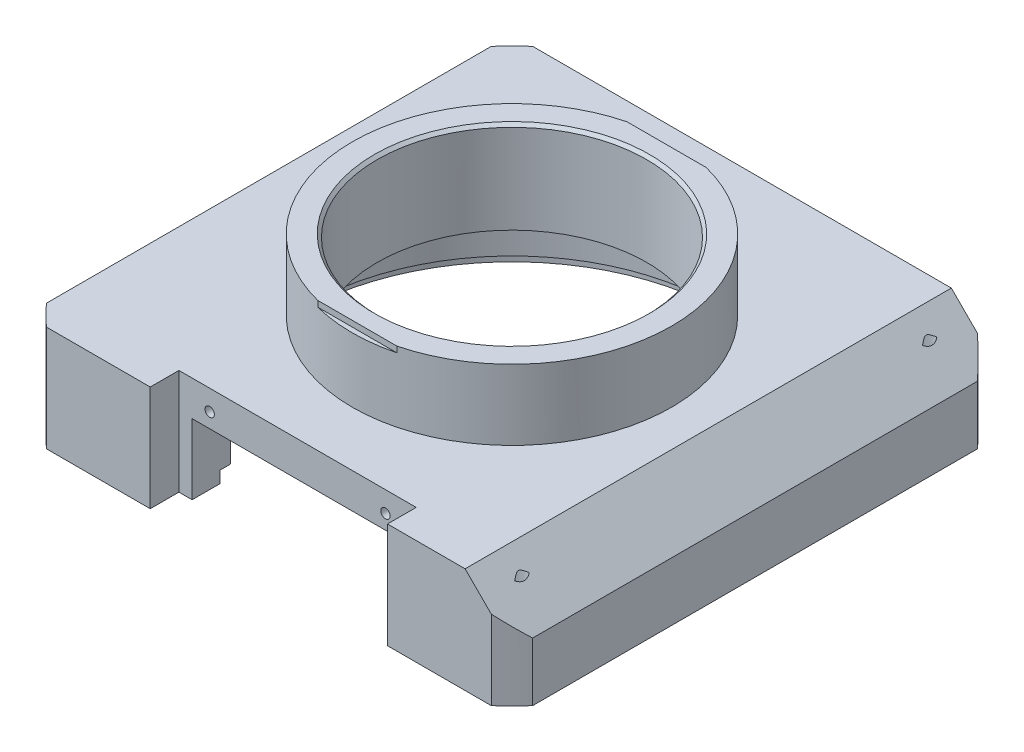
ISO-10303-21;
HEADER;
FILE_DESCRIPTION(('STEP AP214'),'2;1');
FILE_NAME('part.step','',(''),(''),'','','');
FILE_SCHEMA(('AUTOMOTIVE_DESIGN { 1 0 10303 214 1 1 1 1 }'));
ENDSEC;
DATA;
#1=APPLICATION_CONTEXT('core data for automotive mechanical design processes');
#2=APPLICATION_PROTOCOL_DEFINITION('international standard','automotive_design',2000,#1);
#3=PRODUCT_CONTEXT('',#1,'mechanical');
#4=PRODUCT('Part','Part','',(#3));
#5=PRODUCT_RELATED_PRODUCT_CATEGORY('part','',(#4));
#6=PRODUCT_DEFINITION_FORMATION('','',#4);
#7=PRODUCT_DEFINITION_CONTEXT('part definition',#1,'design');
#8=PRODUCT_DEFINITION('design','',#6,#7);
#9=PRODUCT_DEFINITION_SHAPE('','',#8);
#10=(LENGTH_UNIT() NAMED_UNIT(*) SI_UNIT(.MILLI.,.METRE.));
#11=(NAMED_UNIT(*) PLANE_ANGLE_UNIT() SI_UNIT($,.RADIAN.));
#12=(NAMED_UNIT(*) SI_UNIT($,.STERADIAN.) SOLID_ANGLE_UNIT());
#13=UNCERTAINTY_MEASURE_WITH_UNIT(LENGTH_MEASURE(1.E-05),#10,'distance_accuracy_value','');
#14=(GEOMETRIC_REPRESENTATION_CONTEXT(3) GLOBAL_UNCERTAINTY_ASSIGNED_CONTEXT((#13)) GLOBAL_UNIT_ASSIGNED_CONTEXT((#10,
#11,#12)) REPRESENTATION_CONTEXT('',''));
#15=CARTESIAN_POINT('',(0.,0.,0.));
#16=DIRECTION('',(0.,0.,1.));
#17=DIRECTION('',(1.,0.,0.));
#18=AXIS2_PLACEMENT_3D('',#15,#16,#17);
#19=CARTESIAN_POINT('',(0.,14.3,0.));
#20=DIRECTION('',(0.,1.,0.));
#21=DIRECTION('',(0.,0.,1.));
#22=AXIS2_PLACEMENT_3D('',#19,#20,#21);
#23=PLANE('',#22);
#24=DIRECTION('',(0.,0.,1.));
#25=VECTOR('',#24,1.);
#26=CARTESIAN_POINT('',(-14.2254033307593,14.3,0.));
#27=LINE('',#26,#25);
#28=CARTESIAN_POINT('',(-14.2254033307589,14.3,30.5999999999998));
#29=VERTEX_POINT('',#28);
#30=CARTESIAN_POINT('',(-14.2254033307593,14.3,30.8810281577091));
#31=VERTEX_POINT('',#30);
#32=EDGE_CURVE('E261',#29,#31,#27,.T.);
#33=ORIENTED_EDGE('',*,*,#32,.F.);
#34=DIRECTION('',(1.,0.,0.));
#35=VECTOR('',#34,1.);
#36=CARTESIAN_POINT('',(0.,14.3,30.5999999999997));
#37=LINE('',#36,#35);
#38=CARTESIAN_POINT('',(-14.820256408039,14.3,30.5999999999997));
#39=VERTEX_POINT('',#38);
#40=EDGE_CURVE('E242',#39,#29,#37,.T.);
#41=ORIENTED_EDGE('',*,*,#40,.F.);
#42=CARTESIAN_POINT('',(0.,14.3,0.));
#43=DIRECTION('',(0.,1.,0.));
#44=DIRECTION('',(0.,0.,1.));
#45=AXIS2_PLACEMENT_3D('',#42,#43,#44);
#46=CIRCLE('',#45,34.);
#47=CARTESIAN_POINT('',(14.8202564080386,14.3,30.5999999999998));
#48=VERTEX_POINT('',#47);
#49=EDGE_CURVE('E19',#39,#48,#46,.F.);
#50=ORIENTED_EDGE('',*,*,#49,.T.);
#51=DIRECTION('',(1.,0.,0.));
#52=VECTOR('',#51,1.);
#53=CARTESIAN_POINT('',(0.,14.3,30.6));
#54=LINE('',#53,#52);
#55=CARTESIAN_POINT('',(14.2254033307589,14.3,30.6));
#56=VERTEX_POINT('',#55);
#57=EDGE_CURVE('E247',#56,#48,#54,.T.);
#58=ORIENTED_EDGE('',*,*,#57,.F.);
#59=DIRECTION('',(0.,0.,1.));
#60=VECTOR('',#59,1.);
#61=CARTESIAN_POINT('',(14.2254033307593,14.3,0.));
#62=LINE('',#61,#60);
#63=CARTESIAN_POINT('',(14.225403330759,14.2999999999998,30.8810281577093));
#64=VERTEX_POINT('',#63);
#65=EDGE_CURVE('E256',#64,#56,#62,.F.);
#66=ORIENTED_EDGE('',*,*,#65,.F.);
#67=CARTESIAN_POINT('',(0.,14.3,0.));
#68=DIRECTION('',(0.,1.,0.));
#69=DIRECTION('',(0.,0.,1.));
#70=AXIS2_PLACEMENT_3D('',#67,#68,#69);
#71=CIRCLE('',#70,34.);
#72=EDGE_CURVE('E429',#64,#31,#71,.F.);
#73=ORIENTED_EDGE('',*,*,#72,.T.);
#74=EDGE_LOOP('',(#33,#41,#50,#58,#66,#73));
#75=FACE_BOUND('',#74,.T.);
#76=CARTESIAN_POINT('',(0.,14.3,0.));
#77=DIRECTION('',(0.,1.,0.));
#78=DIRECTION('',(0.,0.,1.));
#79=AXIS2_PLACEMENT_3D('',#76,#77,#78);
#80=CIRCLE('',#79,23.);
#81=CARTESIAN_POINT('',(0.,14.3,23.));
#82=VERTEX_POINT('',#81);
#83=EDGE_CURVE('E428',#82,#82,#80,.T.);
#84=ORIENTED_EDGE('',*,*,#83,.T.);
#85=EDGE_LOOP('',(#84));
#86=FACE_BOUND('',#85,.T.);
#87=ADVANCED_FACE('F16',(#75,#86),#23,.F.);
#88=CARTESIAN_POINT('',(0.,0.,0.));
#89=DIRECTION('',(0.,1.,0.));
#90=DIRECTION('',(0.,0.,1.));
#91=AXIS2_PLACEMENT_3D('',#88,#89,#90);
#92=CYLINDRICAL_SURFACE('',#91,34.);
#93=CARTESIAN_POINT('',(0.,14.,0.));
#94=DIRECTION('',(0.,1.,0.));
#95=DIRECTION('',(0.,0.,1.));
#96=AXIS2_PLACEMENT_3D('',#93,#94,#95);
#97=CIRCLE('',#96,34.);
#98=CARTESIAN_POINT('',(-14.8202564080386,14.,30.5999999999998));
#99=VERTEX_POINT('',#98);
#100=CARTESIAN_POINT('',(14.8202564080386,14.,30.5999999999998));
#101=VERTEX_POINT('',#100);
#102=EDGE_CURVE('E264',#99,#101,#97,.F.);
#103=ORIENTED_EDGE('',*,*,#102,.T.);
#104=DIRECTION('',(0.,1.,0.));
#105=VECTOR('',#104,1.);
#106=CARTESIAN_POINT('',(14.820256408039,0.,30.5999999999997));
#107=LINE('',#106,#105);
#108=EDGE_CURVE('E251',#48,#101,#107,.F.);
#109=ORIENTED_EDGE('',*,*,#108,.F.);
#110=ORIENTED_EDGE('',*,*,#49,.F.);
#111=DIRECTION('',(0.,1.,0.));
#112=VECTOR('',#111,1.);
#113=CARTESIAN_POINT('',(-14.820256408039,0.,30.5999999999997));
#114=LINE('',#113,#112);
#115=EDGE_CURVE('E266',#99,#39,#114,.T.);
#116=ORIENTED_EDGE('',*,*,#115,.F.);
#117=EDGE_LOOP('',(#103,#109,#110,#116));
#118=FACE_BOUND('',#117,.T.);
#119=ADVANCED_FACE('F262',(#118),#92,.F.);
#120=CARTESIAN_POINT('',(0.,0.,0.));
#121=DIRECTION('',(0.,1.,0.));
#122=DIRECTION('',(0.,0.,1.));
#123=AXIS2_PLACEMENT_3D('',#120,#121,#122);
#124=CYLINDRICAL_SURFACE('',#123,34.);
#125=CARTESIAN_POINT('',(0.,13.9999999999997,0.));
#126=DIRECTION('',(0.,1.,0.));
#127=DIRECTION('',(0.,0.,1.));
#128=AXIS2_PLACEMENT_3D('',#125,#126,#127);
#129=CIRCLE('',#128,34.);
#130=CARTESIAN_POINT('',(14.3755002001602,13.9999999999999,30.8114425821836));
#131=VERTEX_POINT('',#130);
#132=CARTESIAN_POINT('',(-14.3755002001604,13.9999999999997,30.8114425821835));
#133=VERTEX_POINT('',#132);
#134=EDGE_CURVE('E449',#131,#133,#129,.F.);
#135=ORIENTED_EDGE('',*,*,#134,.T.);
#136=CARTESIAN_POINT('',(-14.2254033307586,14.2999999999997,30.8810281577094));
#137=CARTESIAN_POINT('',(-14.2308562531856,14.2788817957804,30.8785161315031));
#138=CARTESIAN_POINT('',(-14.2371575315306,14.2580472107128,30.8756118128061));
#139=CARTESIAN_POINT('',(-14.2513893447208,14.2170628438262,30.8690454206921));
#140=CARTESIAN_POINT('',(-14.259320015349,14.1969131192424,30.8653832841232));
#141=CARTESIAN_POINT('',(-14.2851197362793,14.1384290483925,30.8534553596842));
#142=CARTESIAN_POINT('',(-14.3052116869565,14.1012424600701,30.8441492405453));
#143=CARTESIAN_POINT('',(-14.33524089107,14.0547106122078,30.8301951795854));
#144=CARTESIAN_POINT('',(-14.342901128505,14.0434853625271,30.8266323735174));
#145=CARTESIAN_POINT('',(-14.3587886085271,14.0214261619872,30.8192353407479));
#146=CARTESIAN_POINT('',(-14.3670189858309,14.0105949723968,30.8153996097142));
#147=CARTESIAN_POINT('',(-14.3755002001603,13.9999999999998,30.8114425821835));
#148=B_SPLINE_CURVE_WITH_KNOTS('',3,(#136,#137,#138,#139,#140,#141,#142,#143,#144,#145,#146,
#147),.UNSPECIFIED.,.F.,.F.,(4,2,2,2,2,4),(0.,0.0658104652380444,0.131626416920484,
0.260737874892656,0.302874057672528,0.345263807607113),.UNSPECIFIED.);
#149=EDGE_CURVE('E421',#31,#133,#148,.T.);
#150=ORIENTED_EDGE('',*,*,#149,.F.);
#151=ORIENTED_EDGE('',*,*,#72,.F.);
#152=CARTESIAN_POINT('',(14.3755002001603,13.9999999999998,30.8114425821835));
#153=CARTESIAN_POINT('',(14.3623314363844,14.0164501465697,30.81758665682));
#154=CARTESIAN_POINT('',(14.3497661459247,14.0334756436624,30.8234388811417));
#155=CARTESIAN_POINT('',(14.3259317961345,14.0686245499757,30.8345236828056));
#156=CARTESIAN_POINT('',(14.3146638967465,14.0867489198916,30.8397557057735));
#157=CARTESIAN_POINT('',(14.2833975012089,14.141898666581,30.8542554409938));
#158=CARTESIAN_POINT('',(14.2654010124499,14.1803669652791,30.8625761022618));
#159=CARTESIAN_POINT('',(14.245681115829,14.2331722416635,30.8716795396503));
#160=CARTESIAN_POINT('',(14.2411622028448,14.2463083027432,30.8737642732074));
#161=CARTESIAN_POINT('',(14.2327771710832,14.2729225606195,30.8776306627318));
#162=CARTESIAN_POINT('',(14.2289152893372,14.2864023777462,30.8794103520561));
#163=CARTESIAN_POINT('',(14.2254033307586,14.2999999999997,30.8810281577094));
#164=B_SPLINE_CURVE_WITH_KNOTS('',3,(#152,#153,#154,#155,#156,#157,#158,#159,#160,#161,#162,
#163),.UNSPECIFIED.,.F.,.F.,(4,2,2,2,2,4),(0.,0.065803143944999,0.131664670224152,
0.260747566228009,0.302874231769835,0.345263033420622),.UNSPECIFIED.);
#165=EDGE_CURVE('E268',#131,#64,#164,.T.);
#166=ORIENTED_EDGE('',*,*,#165,.F.);
#167=EDGE_LOOP('',(#135,#150,#151,#166));
#168=FACE_BOUND('',#167,.T.);
#169=ADVANCED_FACE('F431',(#168),#124,.F.);
#170=CARTESIAN_POINT('',(0.,0.,0.));
#171=DIRECTION('',(0.,1.,0.));
#172=DIRECTION('',(0.,0.,1.));
#173=AXIS2_PLACEMENT_3D('',#170,#171,#172);
#174=CYLINDRICAL_SURFACE('',#173,23.);
#175=ORIENTED_EDGE('',*,*,#83,.F.);
#176=EDGE_LOOP('',(#175));
#177=FACE_BOUND('',#176,.T.);
#178=CARTESIAN_POINT('',(0.,29.5,0.));
#179=DIRECTION('',(0.,1.,0.));
#180=DIRECTION('',(0.,0.,1.));
#181=AXIS2_PLACEMENT_3D('',#178,#179,#180);
#182=CIRCLE('',#181,23.);
#183=CARTESIAN_POINT('',(0.,29.5,23.));
#184=VERTEX_POINT('',#183);
#185=EDGE_CURVE('E271',#184,#184,#182,.T.);
#186=ORIENTED_EDGE('',*,*,#185,.T.);
#187=EDGE_LOOP('',(#186));
#188=FACE_BOUND('',#187,.T.);
#189=ADVANCED_FACE('F435',(#177,#188),#174,.F.);
#190=CARTESIAN_POINT('',(0.,14.,0.));
#191=DIRECTION('',(0.,1.,0.));
#192=DIRECTION('',(0.,0.,1.));
#193=AXIS2_PLACEMENT_3D('',#190,#191,#192);
#194=PLANE('',#193);
#195=DIRECTION('',(0.,0.,1.));
#196=VECTOR('',#195,1.);
#197=CARTESIAN_POINT('',(-15.6244997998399,14.,0.));
#198=LINE('',#197,#196);
#199=CARTESIAN_POINT('',(-15.6244997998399,14.,31.3189240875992));
#200=VERTEX_POINT('',#199);
#201=CARTESIAN_POINT('',(-15.6244997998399,14.,30.6));
#202=VERTEX_POINT('',#201);
#203=EDGE_CURVE('E457',#200,#202,#198,.F.);
#204=ORIENTED_EDGE('',*,*,#203,.F.);
#205=CARTESIAN_POINT('',(0.,14.,0.));
#206=DIRECTION('',(0.,1.,0.));
#207=DIRECTION('',(0.,0.,1.));
#208=AXIS2_PLACEMENT_3D('',#205,#206,#207);
#209=CIRCLE('',#208,35.);
#210=CARTESIAN_POINT('',(15.6244997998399,14.,31.3189240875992));
#211=VERTEX_POINT('',#210);
#212=EDGE_CURVE('E472',#200,#211,#209,.F.);
#213=ORIENTED_EDGE('',*,*,#212,.T.);
#214=DIRECTION('',(0.,0.,1.));
#215=VECTOR('',#214,1.);
#216=CARTESIAN_POINT('',(15.6244997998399,14.,0.));
#217=LINE('',#216,#215);
#218=CARTESIAN_POINT('',(15.6244997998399,14.,30.6));
#219=VERTEX_POINT('',#218);
#220=EDGE_CURVE('E467',#219,#211,#217,.T.);
#221=ORIENTED_EDGE('',*,*,#220,.F.);
#222=DIRECTION('',(-1.,0.,0.));
#223=VECTOR('',#222,1.);
#224=CARTESIAN_POINT('',(15.,14.,30.6));
#225=LINE('',#224,#223);
#226=EDGE_CURVE('E466',#219,#101,#225,.T.);
#227=ORIENTED_EDGE('',*,*,#226,.T.);
#228=ORIENTED_EDGE('',*,*,#102,.F.);
#229=DIRECTION('',(-1.,0.,0.));
#230=VECTOR('',#229,1.);
#231=CARTESIAN_POINT('',(-15.,14.,30.6));
#232=LINE('',#231,#230);
#233=EDGE_CURVE('E462',#99,#202,#232,.T.);
#234=ORIENTED_EDGE('',*,*,#233,.T.);
#235=EDGE_LOOP('',(#204,#213,#221,#227,#228,#234));
#236=FACE_BOUND('',#235,.T.);
#237=ADVANCED_FACE('F464',(#236),#194,.F.);
#238=CARTESIAN_POINT('',(0.,14.,0.));
#239=DIRECTION('',(0.,1.,0.));
#240=DIRECTION('',(0.,0.,1.));
#241=AXIS2_PLACEMENT_3D('',#238,#239,#240);
#242=PLANE('',#241);
#243=ORIENTED_EDGE('',*,*,#134,.F.);
#244=DIRECTION('',(0.,0.,1.));
#245=VECTOR('',#244,1.);
#246=CARTESIAN_POINT('',(14.3755002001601,14.,0.));
#247=LINE('',#246,#245);
#248=CARTESIAN_POINT('',(14.3755002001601,14.,31.9115182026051));
#249=VERTEX_POINT('',#248);
#250=EDGE_CURVE('E471',#249,#131,#247,.F.);
#251=ORIENTED_EDGE('',*,*,#250,.F.);
#252=CARTESIAN_POINT('',(0.,14.,0.));
#253=DIRECTION('',(0.,1.,0.));
#254=DIRECTION('',(0.,0.,1.));
#255=AXIS2_PLACEMENT_3D('',#252,#253,#254);
#256=CIRCLE('',#255,35.);
#257=CARTESIAN_POINT('',(-14.3755002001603,14.,31.911518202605));
#258=VERTEX_POINT('',#257);
#259=EDGE_CURVE('E475',#249,#258,#256,.F.);
#260=ORIENTED_EDGE('',*,*,#259,.T.);
#261=DIRECTION('',(0.,0.,1.));
#262=VECTOR('',#261,1.);
#263=CARTESIAN_POINT('',(-14.3755002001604,14.,0.));
#264=LINE('',#263,#262);
#265=EDGE_CURVE('E455',#133,#258,#264,.T.);
#266=ORIENTED_EDGE('',*,*,#265,.F.);
#267=EDGE_LOOP('',(#243,#251,#260,#266));
#268=FACE_BOUND('',#267,.T.);
#269=ADVANCED_FACE('F583',(#268),#242,.F.);
#270=CARTESIAN_POINT('',(-34.8,15.0000000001,-34.8));
#271=DIRECTION('',(0.,-1.,0.));
#272=DIRECTION('',(1.,0.,0.));
#273=AXIS2_PLACEMENT_3D('',#270,#271,#272);
#274=CONICAL_SURFACE('',#273,2.09999999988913,1.02974425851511);
#275=CARTESIAN_POINT('',(-34.8,16.2618073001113,-34.8));
#276=VERTEX_POINT('',#275);
#277=VERTEX_LOOP('',#276);
#278=FACE_BOUND('',#277,.T.);
#279=CARTESIAN_POINT('',(-34.8,15.,-34.8));
#280=DIRECTION('',(0.,1.,0.));
#281=DIRECTION('',(0.,0.,1.));
#282=AXIS2_PLACEMENT_3D('',#279,#280,#281);
#283=CIRCLE('',#282,2.1);
#284=CARTESIAN_POINT('',(-34.8,15.,-32.7));
#285=VERTEX_POINT('',#284);
#286=EDGE_CURVE('E479',#285,#285,#283,.F.);
#287=ORIENTED_EDGE('',*,*,#286,.T.);
#288=EDGE_LOOP('',(#287));
#289=FACE_BOUND('',#288,.T.);
#290=ADVANCED_FACE('F586',(#278,#289),#274,.F.);
#291=CARTESIAN_POINT('',(-34.8,14.9999999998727,34.8));
#292=DIRECTION('',(0.,-1.,0.));
#293=DIRECTION('',(0.,0.,-1.));
#294=AXIS2_PLACEMENT_3D('',#291,#292,#293);
#295=CONICAL_SURFACE('',#294,2.1000000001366,1.02974425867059);
#296=CARTESIAN_POINT('',(-34.8,16.2618072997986,34.7999999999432));
#297=VERTEX_POINT('',#296);
#298=VERTEX_LOOP('',#297);
#299=FACE_BOUND('',#298,.T.);
#300=CARTESIAN_POINT('',(-34.8,15.,34.8));
#301=DIRECTION('',(0.,-1.,0.));
#302=DIRECTION('',(0.,0.,-1.));
#303=AXIS2_PLACEMENT_3D('',#300,#301,#302);
#304=CIRCLE('',#303,2.1);
#305=CARTESIAN_POINT('',(-34.8,15.,32.7));
#306=VERTEX_POINT('',#305);
#307=EDGE_CURVE('E483',#306,#306,#304,.T.);
#308=ORIENTED_EDGE('',*,*,#307,.T.);
#309=EDGE_LOOP('',(#308));
#310=FACE_BOUND('',#309,.T.);
#311=ADVANCED_FACE('F593',(#299,#310),#295,.F.);
#312=CARTESIAN_POINT('',(0.,30.,0.));
#313=DIRECTION('',(0.,1.,0.));
#314=DIRECTION('',(-1.,0.,0.));
#315=AXIS2_PLACEMENT_3D('',#312,#313,#314);
#316=CONICAL_SURFACE('',#315,23.5,0.785398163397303);
#317=ORIENTED_EDGE('',*,*,#185,.F.);
#318=EDGE_LOOP('',(#317));
#319=FACE_BOUND('',#318,.T.);
#320=CARTESIAN_POINT('',(0.,30.,0.));
#321=DIRECTION('',(0.,1.,0.));
#322=DIRECTION('',(-1.,0.,0.));
#323=AXIS2_PLACEMENT_3D('',#320,#321,#322);
#324=CIRCLE('',#323,23.5);
#325=CARTESIAN_POINT('',(-23.5,30.,0.));
#326=VERTEX_POINT('',#325);
#327=EDGE_CURVE('E484',#326,#326,#324,.F.);
#328=ORIENTED_EDGE('',*,*,#327,.F.);
#329=EDGE_LOOP('',(#328));
#330=FACE_BOUND('',#329,.T.);
#331=ADVANCED_FACE('F927',(#319,#330),#316,.F.);
#332=CARTESIAN_POINT('',(-49.8,29.,-26.4));
#333=DIRECTION('',(0.,0.,1.));
#334=DIRECTION('',(1.,0.,0.));
#335=AXIS2_PLACEMENT_3D('',#332,#333,#334);
#336=PLANE('',#335);
#337=DIRECTION('',(0.,1.,0.));
#338=VECTOR('',#337,1.);
#339=CARTESIAN_POINT('',(-6.75296231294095,29.,-26.4));
#340=LINE('',#339,#338);
#341=CARTESIAN_POINT('',(-6.75296231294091,30.,-26.4));
#342=VERTEX_POINT('',#341);
#343=CARTESIAN_POINT('',(-6.75296231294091,29.,-26.4));
#344=VERTEX_POINT('',#343);
#345=EDGE_CURVE('E567',#342,#344,#340,.F.);
#346=ORIENTED_EDGE('',*,*,#345,.F.);
#347=DIRECTION('',(1.,0.,0.));
#348=VECTOR('',#347,1.);
#349=CARTESIAN_POINT('',(0.,30.,-26.4));
#350=LINE('',#349,#348);
#351=CARTESIAN_POINT('',(6.75296231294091,30.,-26.4));
#352=VERTEX_POINT('',#351);
#353=EDGE_CURVE('E486',#352,#342,#350,.F.);
#354=ORIENTED_EDGE('',*,*,#353,.F.);
#355=DIRECTION('',(0.,1.,0.));
#356=VECTOR('',#355,1.);
#357=CARTESIAN_POINT('',(6.75296231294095,29.,-26.4));
#358=LINE('',#357,#356);
#359=CARTESIAN_POINT('',(6.75296231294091,29.,-26.4));
#360=VERTEX_POINT('',#359);
#361=EDGE_CURVE('E569',#360,#352,#358,.T.);
#362=ORIENTED_EDGE('',*,*,#361,.F.);
#363=DIRECTION('',(1.,0.,0.));
#364=VECTOR('',#363,1.);
#365=CARTESIAN_POINT('',(-49.8,29.,-26.4));
#366=LINE('',#365,#364);
#367=EDGE_CURVE('E482',#360,#344,#366,.F.);
#368=ORIENTED_EDGE('',*,*,#367,.T.);
#369=EDGE_LOOP('',(#346,#354,#362,#368));
#370=FACE_BOUND('',#369,.T.);
#371=ADVANCED_FACE('F919',(#370),#336,.F.);
#372=CARTESIAN_POINT('',(-49.8,49.,26.4));
#373=DIRECTION('',(0.,0.,-1.));
#374=DIRECTION('',(-1.,0.,0.));
#375=AXIS2_PLACEMENT_3D('',#372,#373,#374);
#376=PLANE('',#375);
#377=DIRECTION('',(0.,1.,0.));
#378=VECTOR('',#377,1.);
#379=CARTESIAN_POINT('',(6.75296231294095,49.,26.4));
#380=LINE('',#379,#378);
#381=CARTESIAN_POINT('',(6.75296231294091,30.,26.4));
#382=VERTEX_POINT('',#381);
#383=CARTESIAN_POINT('',(6.75296231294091,29.,26.4));
#384=VERTEX_POINT('',#383);
#385=EDGE_CURVE('E564',#382,#384,#380,.F.);
#386=ORIENTED_EDGE('',*,*,#385,.F.);
#387=DIRECTION('',(1.,0.,0.));
#388=VECTOR('',#387,1.);
#389=CARTESIAN_POINT('',(0.,30.,26.4));
#390=LINE('',#389,#388);
#391=CARTESIAN_POINT('',(-6.75296231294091,30.,26.4));
#392=VERTEX_POINT('',#391);
#393=EDGE_CURVE('E514',#392,#382,#390,.T.);
#394=ORIENTED_EDGE('',*,*,#393,.F.);
#395=DIRECTION('',(0.,1.,0.));
#396=VECTOR('',#395,1.);
#397=CARTESIAN_POINT('',(-6.75296231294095,49.,26.4));
#398=LINE('',#397,#396);
#399=CARTESIAN_POINT('',(-6.75296231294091,29.,26.4));
#400=VERTEX_POINT('',#399);
#401=EDGE_CURVE('E565',#400,#392,#398,.T.);
#402=ORIENTED_EDGE('',*,*,#401,.F.);
#403=DIRECTION('',(1.,0.,0.));
#404=VECTOR('',#403,1.);
#405=CARTESIAN_POINT('',(-49.8,29.,26.4));
#406=LINE('',#405,#404);
#407=EDGE_CURVE('E509',#400,#384,#406,.T.);
#408=ORIENTED_EDGE('',*,*,#407,.T.);
#409=EDGE_LOOP('',(#386,#394,#402,#408));
#410=FACE_BOUND('',#409,.T.);
#411=ADVANCED_FACE('F912',(#410),#376,.F.);
#412=CARTESIAN_POINT('',(15.,14.5,30.6));
#413=DIRECTION('',(0.,0.,-1.));
#414=DIRECTION('',(-1.,0.,0.));
#415=AXIS2_PLACEMENT_3D('',#412,#413,#414);
#416=PLANE('',#415);
#417=CARTESIAN_POINT('',(15.,14.5,30.6));
#418=DIRECTION('',(0.,0.,-1.));
#419=DIRECTION('',(-1.,0.,0.));
#420=AXIS2_PLACEMENT_3D('',#417,#418,#419);
#421=CIRCLE('',#420,0.8);
#422=EDGE_CURVE('E253',#219,#56,#421,.F.);
#423=ORIENTED_EDGE('',*,*,#422,.T.);
#424=ORIENTED_EDGE('',*,*,#57,.T.);
#425=ORIENTED_EDGE('',*,*,#108,.T.);
#426=ORIENTED_EDGE('',*,*,#226,.F.);
#427=EDGE_LOOP('',(#423,#424,#425,#426));
#428=FACE_BOUND('',#427,.T.);
#429=ADVANCED_FACE('F248',(#428),#416,.F.);
#430=CARTESIAN_POINT('',(-15.,14.5,30.6));
#431=DIRECTION('',(0.,0.,-1.));
#432=DIRECTION('',(-1.,0.,0.));
#433=AXIS2_PLACEMENT_3D('',#430,#431,#432);
#434=PLANE('',#433);
#435=ORIENTED_EDGE('',*,*,#40,.T.);
#436=CARTESIAN_POINT('',(-15.,14.5,30.6));
#437=DIRECTION('',(0.,0.,-1.));
#438=DIRECTION('',(-1.,0.,0.));
#439=AXIS2_PLACEMENT_3D('',#436,#437,#438);
#440=CIRCLE('',#439,0.799999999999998);
#441=EDGE_CURVE('E406',#29,#202,#440,.F.);
#442=ORIENTED_EDGE('',*,*,#441,.T.);
#443=ORIENTED_EDGE('',*,*,#233,.F.);
#444=ORIENTED_EDGE('',*,*,#115,.T.);
#445=EDGE_LOOP('',(#435,#442,#443,#444));
#446=FACE_BOUND('',#445,.T.);
#447=ADVANCED_FACE('F461',(#446),#434,.F.);
#448=CARTESIAN_POINT('',(0.,2.,0.));
#449=DIRECTION('',(0.,1.,0.));
#450=DIRECTION('',(0.,0.,1.));
#451=AXIS2_PLACEMENT_3D('',#448,#449,#450);
#452=PLANE('',#451);
#453=CARTESIAN_POINT('',(0.,2.,0.));
#454=DIRECTION('',(0.,1.,0.));
#455=DIRECTION('',(0.,0.,1.));
#456=AXIS2_PLACEMENT_3D('',#453,#454,#455);
#457=CIRCLE('',#456,35.);
#458=CARTESIAN_POINT('',(18.,2.,30.0166620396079));
#459=VERTEX_POINT('',#458);
#460=CARTESIAN_POINT('',(-18.,2.,30.0166620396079));
#461=VERTEX_POINT('',#460);
#462=EDGE_CURVE('E477',#459,#461,#457,.T.);
#463=ORIENTED_EDGE('',*,*,#462,.T.);
#464=DIRECTION('',(0.,0.,1.));
#465=VECTOR('',#464,1.);
#466=CARTESIAN_POINT('',(-18.,2.,41.5));
#467=LINE('',#466,#465);
#468=CARTESIAN_POINT('',(-18.,2.,31.8678521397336));
#469=VERTEX_POINT('',#468);
#470=EDGE_CURVE('E540',#461,#469,#467,.T.);
#471=ORIENTED_EDGE('',*,*,#470,.T.);
#472=CARTESIAN_POINT('',(0.,2.,0.));
#473=DIRECTION('',(0.,1.,0.));
#474=DIRECTION('',(0.,0.,1.));
#475=AXIS2_PLACEMENT_3D('',#472,#473,#474);
#476=CIRCLE('',#475,36.6);
#477=CARTESIAN_POINT('',(18.,2.,31.8678521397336));
#478=VERTEX_POINT('',#477);
#479=EDGE_CURVE('E480',#469,#478,#476,.F.);
#480=ORIENTED_EDGE('',*,*,#479,.T.);
#481=DIRECTION('',(0.,0.,-1.));
#482=VECTOR('',#481,1.);
#483=CARTESIAN_POINT('',(18.,2.,14.31782106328));
#484=LINE('',#483,#482);
#485=EDGE_CURVE('E524',#478,#459,#484,.T.);
#486=ORIENTED_EDGE('',*,*,#485,.T.);
#487=EDGE_LOOP('',(#463,#471,#480,#486));
#488=FACE_BOUND('',#487,.T.);
#489=ADVANCED_FACE('F385',(#488),#452,.F.);
#490=CARTESIAN_POINT('',(0.,0.,0.));
#491=DIRECTION('',(0.,1.,0.));
#492=DIRECTION('',(0.,0.,1.));
#493=AXIS2_PLACEMENT_3D('',#490,#491,#492);
#494=CYLINDRICAL_SURFACE('',#493,35.);
#495=CARTESIAN_POINT('',(0.,12.,0.));
#496=DIRECTION('',(0.,1.,0.));
#497=DIRECTION('',(0.,0.,1.));
#498=AXIS2_PLACEMENT_3D('',#495,#496,#497);
#499=CIRCLE('',#498,35.);
#500=CARTESIAN_POINT('',(-18.,12.,30.0166620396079));
#501=VERTEX_POINT('',#500);
#502=CARTESIAN_POINT('',(18.,12.,30.0166620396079));
#503=VERTEX_POINT('',#502);
#504=EDGE_CURVE('E407',#501,#503,#499,.T.);
#505=ORIENTED_EDGE('',*,*,#504,.F.);
#506=DIRECTION('',(0.,1.,0.));
#507=VECTOR('',#506,1.);
#508=CARTESIAN_POINT('',(-18.,0.,30.0166620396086));
#509=LINE('',#508,#507);
#510=EDGE_CURVE('E405',#501,#461,#509,.F.);
#511=ORIENTED_EDGE('',*,*,#510,.T.);
#512=ORIENTED_EDGE('',*,*,#462,.F.);
#513=DIRECTION('',(0.,1.,0.));
#514=VECTOR('',#513,1.);
#515=CARTESIAN_POINT('',(18.,0.,30.0166620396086));
#516=LINE('',#515,#514);
#517=EDGE_CURVE('E548',#459,#503,#516,.T.);
#518=ORIENTED_EDGE('',*,*,#517,.T.);
#519=EDGE_LOOP('',(#505,#511,#512,#518));
#520=FACE_BOUND('',#519,.T.);
#521=CARTESIAN_POINT('',(-15.6244997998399,14.0000000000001,31.3189240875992));
#522=CARTESIAN_POINT('',(-15.594571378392,13.9625881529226,31.3338572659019));
#523=CARTESIAN_POINT('',(-15.5616070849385,13.928324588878,31.3502469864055));
#524=CARTESIAN_POINT('',(-15.4909901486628,13.8666695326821,31.3851991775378));
#525=CARTESIAN_POINT('',(-15.4533548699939,13.8392536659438,31.403753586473));
#526=CARTESIAN_POINT('',(-15.3746248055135,13.7916409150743,31.442373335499));
#527=CARTESIAN_POINT('',(-15.3335371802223,13.7714295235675,31.4624355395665));
#528=CARTESIAN_POINT('',(-15.2489206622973,13.7383547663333,31.5035336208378));
#529=CARTESIAN_POINT('',(-15.2053894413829,13.7254985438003,31.5245704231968));
#530=CARTESIAN_POINT('',(-15.1138002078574,13.7066594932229,31.568588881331));
#531=CARTESIAN_POINT('',(-15.0656415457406,13.7012362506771,31.5916017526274));
#532=CARTESIAN_POINT('',(-14.9690519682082,13.6991399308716,31.6374832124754));
#533=CARTESIAN_POINT('',(-14.9206209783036,13.7024693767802,31.6603517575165));
#534=CARTESIAN_POINT('',(-14.8233967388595,13.7181399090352,31.7059911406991));
#535=CARTESIAN_POINT('',(-14.7746344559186,13.7307421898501,31.7287394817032));
#536=CARTESIAN_POINT('',(-14.6797919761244,13.7651469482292,31.7727310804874));
#537=CARTESIAN_POINT('',(-14.633708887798,13.7869392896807,31.7939759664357));
#538=CARTESIAN_POINT('',(-14.5496279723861,13.8371676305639,31.8325347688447));
#539=CARTESIAN_POINT('',(-14.5112756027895,13.8648682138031,31.8500296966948));
#540=CARTESIAN_POINT('',(-14.439381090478,13.9272912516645,31.8826893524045));
#541=CARTESIAN_POINT('',(-14.405856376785,13.962038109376,31.8978456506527));
#542=CARTESIAN_POINT('',(-14.3755002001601,14.,31.9115182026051));
#543=B_SPLINE_CURVE_WITH_KNOTS('',3,(#521,#522,#523,#524,#525,#526,#527,#528,#529,#530,#531,
#532,#533,#534,#535,#536,#537,#538,#539,#540,#541,#542),.UNSPECIFIED.,.F.,.F.,(4,2,2,2,2,2,2,2,
2,2,4),(0.,0.150195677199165,0.299848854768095,0.449198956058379,0.598693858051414,
0.758919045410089,0.919190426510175,1.08415797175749,1.24894404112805,1.39951278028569,
1.5506121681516),.UNSPECIFIED.);
#544=EDGE_CURVE('E398',#200,#258,#543,.T.);
#545=ORIENTED_EDGE('',*,*,#544,.T.);
#546=ORIENTED_EDGE('',*,*,#259,.F.);
#547=CARTESIAN_POINT('',(14.3755002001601,14.0000000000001,31.9115182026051));
#548=CARTESIAN_POINT('',(14.4050269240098,13.9630750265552,31.8982191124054));
#549=CARTESIAN_POINT('',(14.437559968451,13.929184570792,31.8835125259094));
#550=CARTESIAN_POINT('',(14.5072365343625,13.8680911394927,31.8518681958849));
#551=CARTESIAN_POINT('',(14.5443623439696,13.8408636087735,31.8349390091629));
#552=CARTESIAN_POINT('',(14.6219928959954,13.7934730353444,31.7993577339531));
#553=CARTESIAN_POINT('',(14.6624914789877,13.773297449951,31.7807087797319));
#554=CARTESIAN_POINT('',(14.7457973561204,13.7401367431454,31.7421418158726));
#555=CARTESIAN_POINT('',(14.7886067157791,13.7271581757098,31.7222226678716));
#556=CARTESIAN_POINT('',(14.8784599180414,13.7078610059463,31.6801839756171));
#557=CARTESIAN_POINT('',(14.9255908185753,13.7020702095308,31.6580078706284));
#558=CARTESIAN_POINT('',(15.0199940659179,13.6988553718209,31.6133280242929));
#559=CARTESIAN_POINT('',(15.0672664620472,13.7014347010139,31.5908241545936));
#560=CARTESIAN_POINT('',(15.1630955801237,13.7152337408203,31.5449439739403));
#561=CARTESIAN_POINT('',(15.2115978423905,13.7268802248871,31.521580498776));
#562=CARTESIAN_POINT('',(15.305979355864,13.7591469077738,31.4758597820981));
#563=CARTESIAN_POINT('',(15.3518608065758,13.7797594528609,31.4535017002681));
#564=CARTESIAN_POINT('',(15.4387008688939,13.829192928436,31.4109661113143));
#565=CARTESIAN_POINT('',(15.4797391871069,13.8578426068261,31.3907541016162));
#566=CARTESIAN_POINT('',(15.556535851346,13.9230863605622,31.3527685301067));
#567=CARTESIAN_POINT('',(15.5922733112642,13.9597105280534,31.3350046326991));
#568=CARTESIAN_POINT('',(15.6244997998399,14.0000000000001,31.3189240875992));
#569=B_SPLINE_CURVE_WITH_KNOTS('',3,(#547,#548,#549,#550,#551,#552,#553,#554,#555,#556,#557,
#558,#559,#560,#561,#562,#563,#564,#565,#566,#567,#568),.UNSPECIFIED.,.F.,.F.,(4,2,2,2,2,2,2,2,
2,2,4),(0.,0.147007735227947,0.293465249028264,0.439660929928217,0.585989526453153,
0.742526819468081,0.899127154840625,1.06357997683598,1.22789269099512,1.38894026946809,
1.55060643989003),.UNSPECIFIED.);
#570=EDGE_CURVE('E390',#249,#211,#569,.T.);
#571=ORIENTED_EDGE('',*,*,#570,.T.);
#572=ORIENTED_EDGE('',*,*,#212,.F.);
#573=EDGE_LOOP('',(#545,#546,#571,#572));
#574=FACE_BOUND('',#573,.T.);
#575=ADVANCED_FACE('F380',(#520,#574),#494,.F.);
#576=CARTESIAN_POINT('',(-34.8,17.07489766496,-34.8));
#577=DIRECTION('',(0.,1.,0.));
#578=DIRECTION('',(0.,0.,1.));
#579=AXIS2_PLACEMENT_3D('',#576,#577,#578);
#580=CYLINDRICAL_SURFACE('',#579,2.1);
#581=ORIENTED_EDGE('',*,*,#286,.F.);
#582=EDGE_LOOP('',(#581));
#583=FACE_BOUND('',#582,.T.);
#584=CARTESIAN_POINT('',(-34.8,0.,-34.8));
#585=DIRECTION('',(0.,1.,0.));
#586=DIRECTION('',(0.,0.,1.));
#587=AXIS2_PLACEMENT_3D('',#584,#585,#586);
#588=CIRCLE('',#587,2.1);
#589=CARTESIAN_POINT('',(-34.8,0.,-32.7));
#590=VERTEX_POINT('',#589);
#591=EDGE_CURVE('E791',#590,#590,#588,.F.);
#592=ORIENTED_EDGE('',*,*,#591,.T.);
#593=EDGE_LOOP('',(#592));
#594=FACE_BOUND('',#593,.T.);
#595=ADVANCED_FACE('F376',(#583,#594),#580,.F.);
#596=CARTESIAN_POINT('',(-34.8,17.07489766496,34.8));
#597=DIRECTION('',(0.,-1.,0.));
#598=DIRECTION('',(0.,0.,-1.));
#599=AXIS2_PLACEMENT_3D('',#596,#597,#598);
#600=CYLINDRICAL_SURFACE('',#599,2.1);
#601=ORIENTED_EDGE('',*,*,#307,.F.);
#602=EDGE_LOOP('',(#601));
#603=FACE_BOUND('',#602,.T.);
#604=CARTESIAN_POINT('',(-34.8,0.,34.8));
#605=DIRECTION('',(0.,-1.,0.));
#606=DIRECTION('',(0.,0.,-1.));
#607=AXIS2_PLACEMENT_3D('',#604,#605,#606);
#608=CIRCLE('',#607,2.1);
#609=CARTESIAN_POINT('',(-34.8,0.,32.7));
#610=VERTEX_POINT('',#609);
#611=EDGE_CURVE('E707',#610,#610,#608,.T.);
#612=ORIENTED_EDGE('',*,*,#611,.T.);
#613=EDGE_LOOP('',(#612));
#614=FACE_BOUND('',#613,.T.);
#615=ADVANCED_FACE('F372',(#603,#614),#600,.F.);
#616=CARTESIAN_POINT('',(0.,0.,0.));
#617=DIRECTION('',(0.,1.,0.));
#618=DIRECTION('',(0.,0.,1.));
#619=AXIS2_PLACEMENT_3D('',#616,#617,#618);
#620=CYLINDRICAL_SURFACE('',#619,36.6);
#621=DIRECTION('',(0.,1.,0.));
#622=VECTOR('',#621,1.);
#623=CARTESIAN_POINT('',(18.,0.,31.8678521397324));
#624=LINE('',#623,#622);
#625=CARTESIAN_POINT('',(18.,0.,31.8678521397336));
#626=VERTEX_POINT('',#625);
#627=EDGE_CURVE('E521',#626,#478,#624,.T.);
#628=ORIENTED_EDGE('',*,*,#627,.T.);
#629=ORIENTED_EDGE('',*,*,#479,.F.);
#630=DIRECTION('',(0.,1.,0.));
#631=VECTOR('',#630,1.);
#632=CARTESIAN_POINT('',(-18.,0.,31.8678521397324));
#633=LINE('',#632,#631);
#634=CARTESIAN_POINT('',(-18.,0.,31.8678521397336));
#635=VERTEX_POINT('',#634);
#636=EDGE_CURVE('E537',#469,#635,#633,.F.);
#637=ORIENTED_EDGE('',*,*,#636,.T.);
#638=CARTESIAN_POINT('',(0.,0.,0.));
#639=DIRECTION('',(0.,1.,0.));
#640=DIRECTION('',(0.,0.,1.));
#641=AXIS2_PLACEMENT_3D('',#638,#639,#640);
#642=CIRCLE('',#641,36.6);
#643=EDGE_CURVE('E701',#635,#626,#642,.F.);
#644=ORIENTED_EDGE('',*,*,#643,.T.);
#645=EDGE_LOOP('',(#628,#629,#637,#644));
#646=FACE_BOUND('',#645,.T.);
#647=ADVANCED_FACE('F368',(#646),#620,.F.);
#648=CARTESIAN_POINT('',(-49.8,29.,-28.4));
#649=DIRECTION('',(0.,-1.,0.));
#650=DIRECTION('',(0.,0.,-1.));
#651=AXIS2_PLACEMENT_3D('',#648,#649,#650);
#652=PLANE('',#651);
#653=ORIENTED_EDGE('',*,*,#367,.F.);
#654=CARTESIAN_POINT('',(0.,29.,0.));
#655=DIRECTION('',(0.,1.,0.));
#656=DIRECTION('',(0.,0.,1.));
#657=AXIS2_PLACEMENT_3D('',#654,#655,#656);
#658=CIRCLE('',#657,27.25);
#659=EDGE_CURVE('E1168',#344,#360,#658,.F.);
#660=ORIENTED_EDGE('',*,*,#659,.F.);
#661=EDGE_LOOP('',(#653,#660));
#662=FACE_BOUND('',#661,.T.);
#663=ADVANCED_FACE('F364',(#662),#652,.F.);
#664=CARTESIAN_POINT('',(0.,30.,0.));
#665=DIRECTION('',(0.,1.,0.));
#666=DIRECTION('',(0.,0.,1.));
#667=AXIS2_PLACEMENT_3D('',#664,#665,#666);
#668=PLANE('',#667);
#669=CARTESIAN_POINT('',(0.,30.,0.));
#670=DIRECTION('',(0.,1.,0.));
#671=DIRECTION('',(0.,0.,1.));
#672=AXIS2_PLACEMENT_3D('',#669,#670,#671);
#673=CIRCLE('',#672,27.25);
#674=EDGE_CURVE('E743',#392,#342,#673,.F.);
#675=ORIENTED_EDGE('',*,*,#674,.F.);
#676=ORIENTED_EDGE('',*,*,#393,.T.);
#677=CARTESIAN_POINT('',(0.,30.,0.));
#678=DIRECTION('',(0.,1.,0.));
#679=DIRECTION('',(0.,0.,1.));
#680=AXIS2_PLACEMENT_3D('',#677,#678,#679);
#681=CIRCLE('',#680,27.25);
#682=EDGE_CURVE('E1164',#352,#382,#681,.F.);
#683=ORIENTED_EDGE('',*,*,#682,.F.);
#684=ORIENTED_EDGE('',*,*,#353,.T.);
#685=EDGE_LOOP('',(#675,#676,#683,#684));
#686=FACE_BOUND('',#685,.T.);
#687=ORIENTED_EDGE('',*,*,#327,.T.);
#688=EDGE_LOOP('',(#687));
#689=FACE_BOUND('',#688,.T.);
#690=ADVANCED_FACE('F360',(#686,#689),#668,.T.);
#691=CARTESIAN_POINT('',(-49.8,29.,26.4));
#692=DIRECTION('',(0.,-1.,0.));
#693=DIRECTION('',(0.,0.,-1.));
#694=AXIS2_PLACEMENT_3D('',#691,#692,#693);
#695=PLANE('',#694);
#696=ORIENTED_EDGE('',*,*,#407,.F.);
#697=CARTESIAN_POINT('',(0.,29.,0.));
#698=DIRECTION('',(0.,1.,0.));
#699=DIRECTION('',(0.,0.,1.));
#700=AXIS2_PLACEMENT_3D('',#697,#698,#699);
#701=CIRCLE('',#700,27.25);
#702=EDGE_CURVE('E349',#384,#400,#701,.F.);
#703=ORIENTED_EDGE('',*,*,#702,.F.);
#704=EDGE_LOOP('',(#696,#703));
#705=FACE_BOUND('',#704,.T.);
#706=ADVANCED_FACE('F356',(#705),#695,.F.);
#707=CARTESIAN_POINT('',(34.8,14.9999999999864,-34.8));
#708=DIRECTION('',(0.,-1.,0.));
#709=DIRECTION('',(0.,0.,-1.));
#710=AXIS2_PLACEMENT_3D('',#707,#708,#709);
#711=CONICAL_SURFACE('',#710,2.10000000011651,1.02974425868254);
#712=CARTESIAN_POINT('',(34.8,16.2618072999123,-34.8000000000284));
#713=VERTEX_POINT('',#712);
#714=VERTEX_LOOP('',#713);
#715=FACE_BOUND('',#714,.T.);
#716=CARTESIAN_POINT('',(34.8,15.0000000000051,-34.8));
#717=DIRECTION('',(0.,-1.,0.));
#718=DIRECTION('',(0.,0.,-1.));
#719=AXIS2_PLACEMENT_3D('',#716,#717,#718);
#720=CIRCLE('',#719,2.1);
#721=CARTESIAN_POINT('',(36.4999999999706,15.0000000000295,-33.567117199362));
#722=VERTEX_POINT('',#721);
#723=CARTESIAN_POINT('',(36.4999999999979,15.0000000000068,-36.0328828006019));
#724=VERTEX_POINT('',#723);
#725=EDGE_CURVE('E505',#722,#724,#720,.T.);
#726=ORIENTED_EDGE('',*,*,#725,.T.);
#727=CARTESIAN_POINT('',(36.499999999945,15.000000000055,-36.0328828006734));
#728=CARTESIAN_POINT('',(36.4760513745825,15.0239486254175,-35.9980132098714));
#729=CARTESIAN_POINT('',(36.4521872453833,15.0478127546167,-35.9630294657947));
#730=CARTESIAN_POINT('',(36.4046779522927,15.0953220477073,-35.8927540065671));
#731=CARTESIAN_POINT('',(36.3810328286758,15.1189671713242,-35.8574622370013));
#732=CARTESIAN_POINT('',(36.3104383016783,15.1895616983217,-35.7509101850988));
#733=CARTESIAN_POINT('',(36.2639071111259,15.2360928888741,-35.6790848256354));
#734=CARTESIAN_POINT('',(36.1838789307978,15.3161210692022,-35.5503101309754));
#735=CARTESIAN_POINT('',(36.1499312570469,15.3500687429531,-35.4939220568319));
#736=CARTESIAN_POINT('',(36.0841794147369,15.4158205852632,-35.378520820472));
#737=CARTESIAN_POINT('',(36.0523771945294,15.4476228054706,-35.3195053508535));
#738=CARTESIAN_POINT('',(36.0030573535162,15.4969426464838,-35.2171729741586));
#739=CARTESIAN_POINT('',(35.9842843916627,15.5157156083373,-35.1750860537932));
#740=CARTESIAN_POINT('',(35.9504079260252,15.5495920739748,-35.0880035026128));
#741=CARTESIAN_POINT('',(35.9352950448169,15.5647049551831,-35.0430156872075));
#742=CARTESIAN_POINT('',(35.9158742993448,15.5841257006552,-34.9663162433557));
#743=CARTESIAN_POINT('',(35.909635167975,15.590364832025,-34.9356193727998));
#744=CARTESIAN_POINT('',(35.9008724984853,15.5991275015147,-34.8732354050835));
#745=CARTESIAN_POINT('',(35.8983356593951,15.6016643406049,-34.841552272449));
#746=CARTESIAN_POINT('',(35.8974818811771,15.6025181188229,-34.7779159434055));
#747=CARTESIAN_POINT('',(35.8991847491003,15.6008152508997,-34.7459621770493));
#748=CARTESIAN_POINT('',(35.9064805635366,15.5935194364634,-34.6829175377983));
#749=CARTESIAN_POINT('',(35.9120849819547,15.5879150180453,-34.6518294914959));
#750=CARTESIAN_POINT('',(35.9306988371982,15.5693011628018,-34.5717941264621));
#751=CARTESIAN_POINT('',(35.9461504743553,15.5538495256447,-34.5240308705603));
#752=CARTESIAN_POINT('',(35.9813959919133,15.5186040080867,-34.4314403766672));
#753=CARTESIAN_POINT('',(36.0012346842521,15.498765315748,-34.3866501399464));
#754=CARTESIAN_POINT('',(36.0399472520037,15.4600527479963,-34.3062515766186));
#755=CARTESIAN_POINT('',(36.0584800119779,15.4415199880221,-34.2703090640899));
#756=CARTESIAN_POINT('',(36.0966346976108,15.4033653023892,-34.1995914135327));
#757=CARTESIAN_POINT('',(36.1162570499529,15.3837429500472,-34.1648167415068));
#758=CARTESIAN_POINT('',(36.1762743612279,15.3237256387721,-34.0615994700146));
#759=CARTESIAN_POINT('',(36.2177424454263,15.2822575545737,-33.9944133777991));
#760=CARTESIAN_POINT('',(36.299093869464,15.200906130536,-33.8665982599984));
#761=CARTESIAN_POINT('',(36.3388800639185,15.1611199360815,-33.8058427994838));
#762=CARTESIAN_POINT('',(36.4190523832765,15.0809476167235,-33.685680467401));
#763=CARTESIAN_POINT('',(36.459434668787,15.040565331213,-33.6262684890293));
#764=CARTESIAN_POINT('',(36.4999999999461,15.000000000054,-33.5671171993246));
#765=B_SPLINE_CURVE_WITH_KNOTS('',3,(#727,#728,#729,#730,#731,#732,#733,#734,#735,#736,#737,
#738,#739,#740,#741,#742,#743,#744,#745,#746,#747,#748,#749,#750,#751,#752,#753,#754,#755,#756,
#757,#758,#759,#760,#761,#762,#763,#764),.UNSPECIFIED.,.F.,.F.,(4,2,2,2,2,2,2,2,2,2,2,2,2,2,2,2,
2,2,4),(0.,0.145827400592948,0.29168110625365,0.583857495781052,0.805995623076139,
1.02833283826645,1.17745464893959,1.32619025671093,1.42166426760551,1.51679442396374,
1.61236984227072,1.7082274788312,1.86490690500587,2.02326744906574,2.1566577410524,
2.29010064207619,2.55754117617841,2.80595485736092,3.053165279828),.UNSPECIFIED.);
#766=EDGE_CURVE('E342',#724,#722,#765,.T.);
#767=ORIENTED_EDGE('',*,*,#766,.T.);
#768=EDGE_LOOP('',(#726,#767));
#769=FACE_BOUND('',#768,.T.);
#770=ADVANCED_FACE('F351',(#715,#769),#711,.F.);
#771=CARTESIAN_POINT('',(34.8,17.07489766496,-34.8));
#772=DIRECTION('',(0.,-1.,0.));
#773=DIRECTION('',(0.,0.,-1.));
#774=AXIS2_PLACEMENT_3D('',#771,#772,#773);
#775=CYLINDRICAL_SURFACE('',#774,2.1);
#776=CARTESIAN_POINT('',(34.8,16.7,-34.8));
#777=DIRECTION('',(-0.707106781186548,-0.707106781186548,0.));
#778=DIRECTION('',(0.707106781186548,-0.707106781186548,0.));
#779=AXIS2_PLACEMENT_3D('',#776,#777,#778);
#780=ELLIPSE('',#779,2.9698484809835,2.1);
#781=EDGE_CURVE('E325',#722,#724,#780,.F.);
#782=ORIENTED_EDGE('',*,*,#781,.T.);
#783=ORIENTED_EDGE('',*,*,#725,.F.);
#784=EDGE_LOOP('',(#782,#783));
#785=FACE_BOUND('',#784,.T.);
#786=CARTESIAN_POINT('',(34.8,0.,-34.8));
#787=DIRECTION('',(0.,-1.,0.));
#788=DIRECTION('',(0.,0.,-1.));
#789=AXIS2_PLACEMENT_3D('',#786,#787,#788);
#790=CIRCLE('',#789,2.1);
#791=CARTESIAN_POINT('',(34.8,0.,-36.9));
#792=VERTEX_POINT('',#791);
#793=EDGE_CURVE('E551',#792,#792,#790,.T.);
#794=ORIENTED_EDGE('',*,*,#793,.T.);
#795=EDGE_LOOP('',(#794));
#796=FACE_BOUND('',#795,.T.);
#797=ADVANCED_FACE('F355',(#785,#796),#775,.F.);
#798=CARTESIAN_POINT('',(34.8,15.0000000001,34.8));
#799=DIRECTION('',(0.,-1.,0.));
#800=DIRECTION('',(1.,0.,0.));
#801=AXIS2_PLACEMENT_3D('',#798,#799,#800);
#802=CONICAL_SURFACE('',#801,2.10000000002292,1.02974425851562);
#803=CARTESIAN_POINT('',(34.8,16.2618073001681,34.8));
#804=VERTEX_POINT('',#803);
#805=VERTEX_LOOP('',#804);
#806=FACE_BOUND('',#805,.T.);
#807=CARTESIAN_POINT('',(34.8,15.0000000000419,34.8));
#808=DIRECTION('',(0.,1.,0.));
#809=DIRECTION('',(0.,0.,1.));
#810=AXIS2_PLACEMENT_3D('',#807,#808,#809);
#811=CIRCLE('',#810,2.1);
#812=CARTESIAN_POINT('',(36.4999999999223,15.0000000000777,36.0328828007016));
#813=VERTEX_POINT('',#812);
#814=CARTESIAN_POINT('',(36.4999999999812,15.0000000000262,33.5671171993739));
#815=VERTEX_POINT('',#814);
#816=EDGE_CURVE('E495',#813,#815,#811,.F.);
#817=ORIENTED_EDGE('',*,*,#816,.T.);
#818=CARTESIAN_POINT('',(36.4999999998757,15.0000000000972,33.5671171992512));
#819=CARTESIAN_POINT('',(36.4760513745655,15.0239486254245,33.6019867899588));
#820=CARTESIAN_POINT('',(36.4521872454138,15.0478127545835,33.6369705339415));
#821=CARTESIAN_POINT('',(36.4046779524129,15.0953220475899,33.7072459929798));
#822=CARTESIAN_POINT('',(36.3810328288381,15.1189671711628,33.7425377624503));
#823=CARTESIAN_POINT('',(36.310438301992,15.1895616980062,33.8490898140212));
#824=CARTESIAN_POINT('',(36.2639071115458,15.2360928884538,33.9209151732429));
#825=CARTESIAN_POINT('',(36.1838789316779,15.3161210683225,34.0496898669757));
#826=CARTESIAN_POINT('',(36.149931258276,15.3500687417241,34.1060779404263));
#827=CARTESIAN_POINT('',(36.0841794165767,15.4158205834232,34.221479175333));
#828=CARTESIAN_POINT('',(36.0523771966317,15.4476228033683,34.280494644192));
#829=CARTESIAN_POINT('',(36.0030573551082,15.4969426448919,34.3828270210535));
#830=CARTESIAN_POINT('',(35.9842843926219,15.5157156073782,34.4249139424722));
#831=CARTESIAN_POINT('',(35.9504079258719,15.5495920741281,34.5119964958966));
#832=CARTESIAN_POINT('',(35.9352950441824,15.5647049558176,34.5569843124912));
#833=CARTESIAN_POINT('',(35.9158742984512,15.5841257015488,34.6336837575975));
#834=CARTESIAN_POINT('',(35.9096351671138,15.5903648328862,34.6643806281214));
#835=CARTESIAN_POINT('',(35.900872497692,15.599127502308,34.7267645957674));
#836=CARTESIAN_POINT('',(35.8983356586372,15.6016643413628,34.7584477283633));
#837=CARTESIAN_POINT('',(35.8974818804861,15.6025181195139,34.8220840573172));
#838=CARTESIAN_POINT('',(35.8991847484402,15.6008152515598,34.854037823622));
#839=CARTESIAN_POINT('',(35.9064805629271,15.5935194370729,34.9170824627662));
#840=CARTESIAN_POINT('',(35.912084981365,15.587915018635,34.948170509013));
#841=CARTESIAN_POINT('',(35.9306988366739,15.5693011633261,35.0282058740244));
#842=CARTESIAN_POINT('',(35.9461504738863,15.5538495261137,35.0759691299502));
#843=CARTESIAN_POINT('',(35.9813959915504,15.5186040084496,35.1685596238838));
#844=CARTESIAN_POINT('',(36.0012346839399,15.4987653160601,35.2133498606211));
#845=CARTESIAN_POINT('',(36.0399472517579,15.4600527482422,35.2937484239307));
#846=CARTESIAN_POINT('',(36.0584800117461,15.4415199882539,35.3296909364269));
#847=CARTESIAN_POINT('',(36.0966346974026,15.4033653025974,35.4004085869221));
#848=CARTESIAN_POINT('',(36.1162570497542,15.3837429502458,35.4351832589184));
#849=CARTESIAN_POINT('',(36.1762743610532,15.3237256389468,35.5384005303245));
#850=CARTESIAN_POINT('',(36.2177424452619,15.2822575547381,35.6055866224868));
#851=CARTESIAN_POINT('',(36.2990938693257,15.2009061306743,35.7334017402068));
#852=CARTESIAN_POINT('',(36.3388800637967,15.1611199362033,35.7941572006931));
#853=CARTESIAN_POINT('',(36.4190523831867,15.0809476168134,35.9143195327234));
#854=CARTESIAN_POINT('',(36.4594346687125,15.0405653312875,35.9737315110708));
#855=CARTESIAN_POINT('',(36.4999999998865,15.0000000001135,36.0328828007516));
#856=B_SPLINE_CURVE_WITH_KNOTS('',3,(#818,#819,#820,#821,#822,#823,#824,#825,#826,#827,#828,
#829,#830,#831,#832,#833,#834,#835,#836,#837,#838,#839,#840,#841,#842,#843,#844,#845,#846,#847,
#848,#849,#850,#851,#852,#853,#854,#855),.UNSPECIFIED.,.F.,.F.,(4,2,2,2,2,2,2,2,2,2,2,2,2,2,2,2,
2,2,4),(0.,0.145827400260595,0.291681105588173,0.583857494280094,0.805995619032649,
1.0283328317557,1.17745464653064,1.32619025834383,1.42166426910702,1.51679442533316,
1.61236984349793,1.70822747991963,1.8649069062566,2.02326745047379,2.15665774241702,
2.29010064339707,2.55754117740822,2.80595485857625,3.05316528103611),.UNSPECIFIED.);
#857=EDGE_CURVE('E318',#815,#813,#856,.T.);
#858=ORIENTED_EDGE('',*,*,#857,.T.);
#859=EDGE_LOOP('',(#817,#858));
#860=FACE_BOUND('',#859,.T.);
#861=ADVANCED_FACE('F327',(#806,#860),#802,.F.);
#862=CARTESIAN_POINT('',(34.8,17.07489766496,34.8));
#863=DIRECTION('',(0.,1.,0.));
#864=DIRECTION('',(0.,0.,1.));
#865=AXIS2_PLACEMENT_3D('',#862,#863,#864);
#866=CYLINDRICAL_SURFACE('',#865,2.1);
#867=CARTESIAN_POINT('',(34.8,0.,34.8));
#868=DIRECTION('',(0.,1.,0.));
#869=DIRECTION('',(0.,0.,1.));
#870=AXIS2_PLACEMENT_3D('',#867,#868,#869);
#871=CIRCLE('',#870,2.1);
#872=CARTESIAN_POINT('',(34.8,0.,36.9));
#873=VERTEX_POINT('',#872);
#874=EDGE_CURVE('E794',#873,#873,#871,.F.);
#875=ORIENTED_EDGE('',*,*,#874,.T.);
#876=EDGE_LOOP('',(#875));
#877=FACE_BOUND('',#876,.T.);
#878=CARTESIAN_POINT('',(34.8,16.7,34.8));
#879=DIRECTION('',(-0.707106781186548,-0.707106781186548,0.));
#880=DIRECTION('',(-0.707106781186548,0.707106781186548,0.));
#881=AXIS2_PLACEMENT_3D('',#878,#879,#880);
#882=ELLIPSE('',#881,2.9698484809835,2.1);
#883=EDGE_CURVE('E315',#813,#815,#882,.F.);
#884=ORIENTED_EDGE('',*,*,#883,.T.);
#885=ORIENTED_EDGE('',*,*,#816,.F.);
#886=EDGE_LOOP('',(#884,#885));
#887=FACE_BOUND('',#886,.T.);
#888=ADVANCED_FACE('F844',(#877,#887),#866,.F.);
#889=CARTESIAN_POINT('',(0.,18.,0.));
#890=DIRECTION('',(0.,1.,0.));
#891=DIRECTION('',(0.,0.,1.));
#892=AXIS2_PLACEMENT_3D('',#889,#890,#891);
#893=CYLINDRICAL_SURFACE('',#892,56.25);
#894=DIRECTION('',(0.,1.,0.));
#895=VECTOR('',#894,1.);
#896=CARTESIAN_POINT('',(37.9712061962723,0.,41.5));
#897=LINE('',#896,#895);
#898=CARTESIAN_POINT('',(37.9712061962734,0.,41.5));
#899=VERTEX_POINT('',#898);
#900=CARTESIAN_POINT('',(37.9712061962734,13.5287938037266,41.5));
#901=VERTEX_POINT('',#900);
#902=EDGE_CURVE('E501',#899,#901,#897,.T.);
#903=ORIENTED_EDGE('',*,*,#902,.F.);
#904=CARTESIAN_POINT('',(0.,0.,0.));
#905=DIRECTION('',(0.,1.,0.));
#906=DIRECTION('',(0.,0.,1.));
#907=AXIS2_PLACEMENT_3D('',#904,#905,#906);
#908=CIRCLE('',#907,56.25);
#909=CARTESIAN_POINT('',(41.5000000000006,0.,37.9712061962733));
#910=VERTEX_POINT('',#909);
#911=EDGE_CURVE('E698',#899,#910,#908,.T.);
#912=ORIENTED_EDGE('',*,*,#911,.T.);
#913=DIRECTION('',(0.,1.,0.));
#914=VECTOR('',#913,1.);
#915=CARTESIAN_POINT('',(41.5,0.,37.9712061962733));
#916=LINE('',#915,#914);
#917=CARTESIAN_POINT('',(41.5,10.,37.9712061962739));
#918=VERTEX_POINT('',#917);
#919=EDGE_CURVE('E490',#918,#910,#916,.F.);
#920=ORIENTED_EDGE('',*,*,#919,.F.);
#921=CARTESIAN_POINT('',(0.,51.5,0.));
#922=DIRECTION('',(-0.707106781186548,-0.707106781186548,0.));
#923=DIRECTION('',(-0.707106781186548,0.707106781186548,0.));
#924=AXIS2_PLACEMENT_3D('',#921,#922,#923);
#925=ELLIPSE('',#924,79.5495128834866,56.25);
#926=EDGE_CURVE('E313',#918,#901,#925,.T.);
#927=ORIENTED_EDGE('',*,*,#926,.T.);
#928=EDGE_LOOP('',(#903,#912,#920,#927));
#929=FACE_BOUND('',#928,.T.);
#930=ADVANCED_FACE('F837',(#929),#893,.T.);
#931=CARTESIAN_POINT('',(41.5,0.,41.5));
#932=DIRECTION('',(1.,0.,0.));
#933=DIRECTION('',(0.,0.,-1.));
#934=AXIS2_PLACEMENT_3D('',#931,#932,#933);
#935=PLANE('',#934);
#936=ORIENTED_EDGE('',*,*,#919,.T.);
#937=DIRECTION('',(0.,0.,1.));
#938=VECTOR('',#937,1.);
#939=CARTESIAN_POINT('',(41.5000000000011,0.,0.));
#940=LINE('',#939,#938);
#941=CARTESIAN_POINT('',(41.5000000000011,0.,-37.9712061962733));
#942=VERTEX_POINT('',#941);
#943=EDGE_CURVE('E695',#910,#942,#940,.F.);
#944=ORIENTED_EDGE('',*,*,#943,.T.);
#945=DIRECTION('',(0.,1.,0.));
#946=VECTOR('',#945,1.);
#947=CARTESIAN_POINT('',(41.5000000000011,18.,-37.9712061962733));
#948=LINE('',#947,#946);
#949=CARTESIAN_POINT('',(41.5000000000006,9.99999999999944,-37.9712061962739));
#950=VERTEX_POINT('',#949);
#951=EDGE_CURVE('E487',#950,#942,#948,.F.);
#952=ORIENTED_EDGE('',*,*,#951,.F.);
#953=DIRECTION('',(0.,0.,1.));
#954=VECTOR('',#953,1.);
#955=CARTESIAN_POINT('',(41.5,10.,67.5));
#956=LINE('',#955,#954);
#957=EDGE_CURVE('E311',#950,#918,#956,.T.);
#958=ORIENTED_EDGE('',*,*,#957,.T.);
#959=EDGE_LOOP('',(#936,#944,#952,#958));
#960=FACE_BOUND('',#959,.T.);
#961=ADVANCED_FACE('F782',(#960),#935,.T.);
#962=CARTESIAN_POINT('',(0.,18.,0.));
#963=DIRECTION('',(0.,1.,0.));
#964=DIRECTION('',(0.,0.,1.));
#965=AXIS2_PLACEMENT_3D('',#962,#963,#964);
#966=CYLINDRICAL_SURFACE('',#965,56.25);
#967=ORIENTED_EDGE('',*,*,#951,.T.);
#968=CARTESIAN_POINT('',(0.,0.,0.));
#969=DIRECTION('',(0.,1.,0.));
#970=DIRECTION('',(0.,0.,1.));
#971=AXIS2_PLACEMENT_3D('',#968,#969,#970);
#972=CIRCLE('',#971,56.25);
#973=CARTESIAN_POINT('',(37.9712061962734,0.,-41.5));
#974=VERTEX_POINT('',#973);
#975=EDGE_CURVE('E697',#942,#974,#972,.T.);
#976=ORIENTED_EDGE('',*,*,#975,.T.);
#977=DIRECTION('',(0.,1.,0.));
#978=VECTOR('',#977,1.);
#979=CARTESIAN_POINT('',(37.9712061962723,0.,-41.5));
#980=LINE('',#979,#978);
#981=CARTESIAN_POINT('',(37.9712061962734,13.5287938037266,-41.5));
#982=VERTEX_POINT('',#981);
#983=EDGE_CURVE('E498',#982,#974,#980,.F.);
#984=ORIENTED_EDGE('',*,*,#983,.F.);
#985=CARTESIAN_POINT('',(0.,51.5,0.));
#986=DIRECTION('',(-0.707106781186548,-0.707106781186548,0.));
#987=DIRECTION('',(-0.707106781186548,0.707106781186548,0.));
#988=AXIS2_PLACEMENT_3D('',#985,#986,#987);
#989=ELLIPSE('',#988,79.5495128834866,56.25);
#990=EDGE_CURVE('E308',#982,#950,#989,.T.);
#991=ORIENTED_EDGE('',*,*,#990,.T.);
#992=EDGE_LOOP('',(#967,#976,#984,#991));
#993=FACE_BOUND('',#992,.T.);
#994=ADVANCED_FACE('F739',(#993),#966,.T.);
#995=CARTESIAN_POINT('',(15.,14.5,36.6));
#996=DIRECTION('',(0.,0.,-1.));
#997=DIRECTION('',(-1.,0.,0.));
#998=AXIS2_PLACEMENT_3D('',#995,#996,#997);
#999=CYLINDRICAL_SURFACE('',#998,0.8);
#1000=ORIENTED_EDGE('',*,*,#65,.T.);
#1001=ORIENTED_EDGE('',*,*,#422,.F.);
#1002=ORIENTED_EDGE('',*,*,#220,.T.);
#1003=ORIENTED_EDGE('',*,*,#570,.F.);
#1004=ORIENTED_EDGE('',*,*,#250,.T.);
#1005=ORIENTED_EDGE('',*,*,#165,.T.);
#1006=EDGE_LOOP('',(#1000,#1001,#1002,#1003,#1004,#1005));
#1007=FACE_BOUND('',#1006,.T.);
#1008=CARTESIAN_POINT('',(15.,14.5,36.6));
#1009=DIRECTION('',(0.,0.,-1.));
#1010=DIRECTION('',(-1.,0.,0.));
#1011=AXIS2_PLACEMENT_3D('',#1008,#1009,#1010);
#1012=CIRCLE('',#1011,0.8);
#1013=CARTESIAN_POINT('',(14.2,14.5,36.6));
#1014=VERTEX_POINT('',#1013);
#1015=EDGE_CURVE('E294',#1014,#1014,#1012,.T.);
#1016=ORIENTED_EDGE('',*,*,#1015,.F.);
#1017=EDGE_LOOP('',(#1016));
#1018=FACE_BOUND('',#1017,.T.);
#1019=ADVANCED_FACE('F414',(#1007,#1018),#999,.F.);
#1020=CARTESIAN_POINT('',(-15.,14.5,36.6));
#1021=DIRECTION('',(0.,0.,-1.));
#1022=DIRECTION('',(-1.,0.,0.));
#1023=AXIS2_PLACEMENT_3D('',#1020,#1021,#1022);
#1024=CYLINDRICAL_SURFACE('',#1023,0.799999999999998);
#1025=ORIENTED_EDGE('',*,*,#203,.T.);
#1026=ORIENTED_EDGE('',*,*,#441,.F.);
#1027=ORIENTED_EDGE('',*,*,#32,.T.);
#1028=ORIENTED_EDGE('',*,*,#149,.T.);
#1029=ORIENTED_EDGE('',*,*,#265,.T.);
#1030=ORIENTED_EDGE('',*,*,#544,.F.);
#1031=EDGE_LOOP('',(#1025,#1026,#1027,#1028,#1029,#1030));
#1032=FACE_BOUND('',#1031,.T.);
#1033=CARTESIAN_POINT('',(-15.,14.5,36.6));
#1034=DIRECTION('',(0.,0.,-1.));
#1035=DIRECTION('',(-1.,0.,0.));
#1036=AXIS2_PLACEMENT_3D('',#1033,#1034,#1035);
#1037=CIRCLE('',#1036,0.799999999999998);
#1038=CARTESIAN_POINT('',(-15.8,14.5,36.6));
#1039=VERTEX_POINT('',#1038);
#1040=EDGE_CURVE('E290',#1039,#1039,#1037,.T.);
#1041=ORIENTED_EDGE('',*,*,#1040,.F.);
#1042=EDGE_LOOP('',(#1041));
#1043=FACE_BOUND('',#1042,.T.);
#1044=ADVANCED_FACE('F409',(#1032,#1043),#1024,.F.);
#1045=CARTESIAN_POINT('',(-18.,0.,41.5));
#1046=DIRECTION('',(-1.,0.,0.));
#1047=DIRECTION('',(0.,0.,1.));
#1048=AXIS2_PLACEMENT_3D('',#1045,#1046,#1047);
#1049=PLANE('',#1048);
#1050=ORIENTED_EDGE('',*,*,#470,.F.);
#1051=ORIENTED_EDGE('',*,*,#510,.F.);
#1052=DIRECTION('',(0.,0.,-1.));
#1053=VECTOR('',#1052,1.);
#1054=CARTESIAN_POINT('',(-18.,12.,0.));
#1055=LINE('',#1054,#1053);
#1056=CARTESIAN_POINT('',(-18.,12.,36.6));
#1057=VERTEX_POINT('',#1056);
#1058=EDGE_CURVE('E539',#1057,#501,#1055,.T.);
#1059=ORIENTED_EDGE('',*,*,#1058,.F.);
#1060=DIRECTION('',(0.,1.,0.));
#1061=VECTOR('',#1060,1.);
#1062=CARTESIAN_POINT('',(-18.,0.,36.6));
#1063=LINE('',#1062,#1061);
#1064=CARTESIAN_POINT('',(-18.,0.,36.6));
#1065=VERTEX_POINT('',#1064);
#1066=EDGE_CURVE('E541',#1065,#1057,#1063,.T.);
#1067=ORIENTED_EDGE('',*,*,#1066,.F.);
#1068=DIRECTION('',(0.,0.,1.));
#1069=VECTOR('',#1068,1.);
#1070=CARTESIAN_POINT('',(-18.,0.,0.));
#1071=LINE('',#1070,#1069);
#1072=EDGE_CURVE('E704',#1065,#635,#1071,.F.);
#1073=ORIENTED_EDGE('',*,*,#1072,.T.);
#1074=ORIENTED_EDGE('',*,*,#636,.F.);
#1075=EDGE_LOOP('',(#1050,#1051,#1059,#1067,#1073,#1074));
#1076=FACE_BOUND('',#1075,.T.);
#1077=ADVANCED_FACE('F413',(#1076),#1049,.F.);
#1078=CARTESIAN_POINT('',(0.,12.,0.));
#1079=DIRECTION('',(0.,-1.,0.));
#1080=DIRECTION('',(0.,0.,-1.));
#1081=AXIS2_PLACEMENT_3D('',#1078,#1079,#1080);
#1082=PLANE('',#1081);
#1083=ORIENTED_EDGE('',*,*,#1058,.T.);
#1084=ORIENTED_EDGE('',*,*,#504,.T.);
#1085=DIRECTION('',(0.,0.,-1.));
#1086=VECTOR('',#1085,1.);
#1087=CARTESIAN_POINT('',(18.,12.,14.31782106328));
#1088=LINE('',#1087,#1086);
#1089=CARTESIAN_POINT('',(18.,12.,36.6));
#1090=VERTEX_POINT('',#1089);
#1091=EDGE_CURVE('E525',#503,#1090,#1088,.F.);
#1092=ORIENTED_EDGE('',*,*,#1091,.T.);
#1093=DIRECTION('',(1.,0.,0.));
#1094=VECTOR('',#1093,1.);
#1095=CARTESIAN_POINT('',(-41.5,12.,36.6));
#1096=LINE('',#1095,#1094);
#1097=EDGE_CURVE('E534',#1057,#1090,#1096,.T.);
#1098=ORIENTED_EDGE('',*,*,#1097,.F.);
#1099=EDGE_LOOP('',(#1083,#1084,#1092,#1098));
#1100=FACE_BOUND('',#1099,.T.);
#1101=ADVANCED_FACE('F767',(#1100),#1082,.T.);
#1102=CARTESIAN_POINT('',(18.,0.,14.31782106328));
#1103=DIRECTION('',(1.,0.,0.));
#1104=DIRECTION('',(0.,0.,-1.));
#1105=AXIS2_PLACEMENT_3D('',#1102,#1103,#1104);
#1106=PLANE('',#1105);
#1107=ORIENTED_EDGE('',*,*,#485,.F.);
#1108=ORIENTED_EDGE('',*,*,#627,.F.);
#1109=DIRECTION('',(0.,0.,1.));
#1110=VECTOR('',#1109,1.);
#1111=CARTESIAN_POINT('',(18.,0.,0.));
#1112=LINE('',#1111,#1110);
#1113=CARTESIAN_POINT('',(18.,0.,36.6));
#1114=VERTEX_POINT('',#1113);
#1115=EDGE_CURVE('E699',#626,#1114,#1112,.T.);
#1116=ORIENTED_EDGE('',*,*,#1115,.T.);
#1117=DIRECTION('',(0.,1.,0.));
#1118=VECTOR('',#1117,1.);
#1119=CARTESIAN_POINT('',(18.,0.,36.6));
#1120=LINE('',#1119,#1118);
#1121=EDGE_CURVE('E529',#1090,#1114,#1120,.F.);
#1122=ORIENTED_EDGE('',*,*,#1121,.F.);
#1123=ORIENTED_EDGE('',*,*,#1091,.F.);
#1124=ORIENTED_EDGE('',*,*,#517,.F.);
#1125=EDGE_LOOP('',(#1107,#1108,#1116,#1122,#1123,#1124));
#1126=FACE_BOUND('',#1125,.T.);
#1127=ADVANCED_FACE('F772',(#1126),#1106,.F.);
#1128=CARTESIAN_POINT('',(0.,0.,0.));
#1129=DIRECTION('',(0.,1.,0.));
#1130=DIRECTION('',(0.,0.,1.));
#1131=AXIS2_PLACEMENT_3D('',#1128,#1129,#1130);
#1132=PLANE('',#1131);
#1133=CARTESIAN_POINT('',(0.,0.,0.));
#1134=DIRECTION('',(0.,1.,0.));
#1135=DIRECTION('',(0.,0.,1.));
#1136=AXIS2_PLACEMENT_3D('',#1133,#1134,#1135);
#1137=CIRCLE('',#1136,56.25);
#1138=CARTESIAN_POINT('',(-41.5000000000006,0.,37.971206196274));
#1139=VERTEX_POINT('',#1138);
#1140=CARTESIAN_POINT('',(-37.9712061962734,0.,41.5));
#1141=VERTEX_POINT('',#1140);
#1142=EDGE_CURVE('E298',#1139,#1141,#1137,.T.);
#1143=ORIENTED_EDGE('',*,*,#1142,.F.);
#1144=DIRECTION('',(0.,0.,1.));
#1145=VECTOR('',#1144,1.);
#1146=CARTESIAN_POINT('',(-41.5,0.,-41.5));
#1147=LINE('',#1146,#1145);
#1148=CARTESIAN_POINT('',(-41.5,0.,-37.9712061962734));
#1149=VERTEX_POINT('',#1148);
#1150=EDGE_CURVE('E306',#1149,#1139,#1147,.T.);
#1151=ORIENTED_EDGE('',*,*,#1150,.F.);
#1152=CARTESIAN_POINT('',(0.,0.,0.));
#1153=DIRECTION('',(0.,1.,0.));
#1154=DIRECTION('',(0.,0.,1.));
#1155=AXIS2_PLACEMENT_3D('',#1152,#1153,#1154);
#1156=CIRCLE('',#1155,56.25);
#1157=CARTESIAN_POINT('',(-37.9712061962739,0.,-41.5000000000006));
#1158=VERTEX_POINT('',#1157);
#1159=EDGE_CURVE('E303',#1158,#1149,#1156,.T.);
#1160=ORIENTED_EDGE('',*,*,#1159,.F.);
#1161=DIRECTION('',(-1.,0.,0.));
#1162=VECTOR('',#1161,1.);
#1163=CARTESIAN_POINT('',(41.5,0.,-41.5));
#1164=LINE('',#1163,#1162);
#1165=EDGE_CURVE('E674',#974,#1158,#1164,.T.);
#1166=ORIENTED_EDGE('',*,*,#1165,.F.);
#1167=ORIENTED_EDGE('',*,*,#975,.F.);
#1168=ORIENTED_EDGE('',*,*,#943,.F.);
#1169=ORIENTED_EDGE('',*,*,#911,.F.);
#1170=DIRECTION('',(1.,0.,0.));
#1171=VECTOR('',#1170,1.);
#1172=CARTESIAN_POINT('',(-41.5,0.,41.5));
#1173=LINE('',#1172,#1171);
#1174=CARTESIAN_POINT('',(20.25,0.,41.5));
#1175=VERTEX_POINT('',#1174);
#1176=EDGE_CURVE('E348',#1175,#899,#1173,.T.);
#1177=ORIENTED_EDGE('',*,*,#1176,.F.);
#1178=DIRECTION('',(0.,0.,-1.));
#1179=VECTOR('',#1178,1.);
#1180=CARTESIAN_POINT('',(20.25,0.,41.5));
#1181=LINE('',#1180,#1179);
#1182=CARTESIAN_POINT('',(20.25,0.,36.6));
#1183=VERTEX_POINT('',#1182);
#1184=EDGE_CURVE('E659',#1175,#1183,#1181,.T.);
#1185=ORIENTED_EDGE('',*,*,#1184,.T.);
#1186=DIRECTION('',(1.,0.,0.));
#1187=VECTOR('',#1186,1.);
#1188=CARTESIAN_POINT('',(-41.5,0.,36.6));
#1189=LINE('',#1188,#1187);
#1190=EDGE_CURVE('E526',#1114,#1183,#1189,.T.);
#1191=ORIENTED_EDGE('',*,*,#1190,.F.);
#1192=ORIENTED_EDGE('',*,*,#1115,.F.);
#1193=ORIENTED_EDGE('',*,*,#643,.F.);
#1194=ORIENTED_EDGE('',*,*,#1072,.F.);
#1195=DIRECTION('',(1.,0.,0.));
#1196=VECTOR('',#1195,1.);
#1197=CARTESIAN_POINT('',(-41.5,0.,36.6));
#1198=LINE('',#1197,#1196);
#1199=CARTESIAN_POINT('',(-20.25,0.,36.6));
#1200=VERTEX_POINT('',#1199);
#1201=EDGE_CURVE('E544',#1200,#1065,#1198,.T.);
#1202=ORIENTED_EDGE('',*,*,#1201,.F.);
#1203=DIRECTION('',(0.,0.,1.));
#1204=VECTOR('',#1203,1.);
#1205=CARTESIAN_POINT('',(-20.25,0.,41.5));
#1206=LINE('',#1205,#1204);
#1207=CARTESIAN_POINT('',(-20.25,0.,41.5));
#1208=VERTEX_POINT('',#1207);
#1209=EDGE_CURVE('E663',#1200,#1208,#1206,.T.);
#1210=ORIENTED_EDGE('',*,*,#1209,.T.);
#1211=DIRECTION('',(1.,0.,0.));
#1212=VECTOR('',#1211,1.);
#1213=CARTESIAN_POINT('',(-41.5,0.,41.5));
#1214=LINE('',#1213,#1212);
#1215=EDGE_CURVE('E301',#1141,#1208,#1214,.T.);
#1216=ORIENTED_EDGE('',*,*,#1215,.F.);
#1217=EDGE_LOOP('',(#1143,#1151,#1160,#1166,#1167,#1168,#1169,#1177,#1185,#1191,#1192,#1193,
#1194,#1202,#1210,#1216));
#1218=FACE_BOUND('',#1217,.T.);
#1219=ORIENTED_EDGE('',*,*,#611,.F.);
#1220=EDGE_LOOP('',(#1219));
#1221=FACE_BOUND('',#1220,.T.);
#1222=ORIENTED_EDGE('',*,*,#591,.F.);
#1223=EDGE_LOOP('',(#1222));
#1224=FACE_BOUND('',#1223,.T.);
#1225=ORIENTED_EDGE('',*,*,#874,.F.);
#1226=EDGE_LOOP('',(#1225));
#1227=FACE_BOUND('',#1226,.T.);
#1228=ORIENTED_EDGE('',*,*,#793,.F.);
#1229=EDGE_LOOP('',(#1228));
#1230=FACE_BOUND('',#1229,.T.);
#1231=ADVANCED_FACE('F746',(#1218,#1221,#1224,#1227,#1230),#1132,.F.);
#1232=CARTESIAN_POINT('',(0.,30.,0.));
#1233=DIRECTION('',(0.,1.,0.));
#1234=DIRECTION('',(0.,0.,1.));
#1235=AXIS2_PLACEMENT_3D('',#1232,#1233,#1234);
#1236=CYLINDRICAL_SURFACE('',#1235,27.25);
#1237=ORIENTED_EDGE('',*,*,#345,.T.);
#1238=ORIENTED_EDGE('',*,*,#659,.T.);
#1239=ORIENTED_EDGE('',*,*,#361,.T.);
#1240=ORIENTED_EDGE('',*,*,#682,.T.);
#1241=ORIENTED_EDGE('',*,*,#385,.T.);
#1242=ORIENTED_EDGE('',*,*,#702,.T.);
#1243=ORIENTED_EDGE('',*,*,#401,.T.);
#1244=ORIENTED_EDGE('',*,*,#674,.T.);
#1245=EDGE_LOOP('',(#1237,#1238,#1239,#1240,#1241,#1242,#1243,#1244));
#1246=FACE_BOUND('',#1245,.T.);
#1247=CARTESIAN_POINT('',(0.,18.,0.));
#1248=DIRECTION('',(0.,1.,0.));
#1249=DIRECTION('',(0.,0.,1.));
#1250=AXIS2_PLACEMENT_3D('',#1247,#1248,#1249);
#1251=CIRCLE('',#1250,27.25);
#1252=CARTESIAN_POINT('',(0.,18.,27.25));
#1253=VERTEX_POINT('',#1252);
#1254=EDGE_CURVE('E286',#1253,#1253,#1251,.F.);
#1255=ORIENTED_EDGE('',*,*,#1254,.F.);
#1256=EDGE_LOOP('',(#1255));
#1257=FACE_BOUND('',#1256,.T.);
#1258=ADVANCED_FACE('F801',(#1246,#1257),#1236,.T.);
#1259=CARTESIAN_POINT('',(-41.5,0.,41.5));
#1260=DIRECTION('',(0.,0.,1.));
#1261=DIRECTION('',(1.,0.,0.));
#1262=AXIS2_PLACEMENT_3D('',#1259,#1260,#1261);
#1263=PLANE('',#1262);
#1264=DIRECTION('',(0.,1.,0.));
#1265=VECTOR('',#1264,1.);
#1266=CARTESIAN_POINT('',(20.25,0.,41.5));
#1267=LINE('',#1266,#1265);
#1268=CARTESIAN_POINT('',(20.25,18.,41.5));
#1269=VERTEX_POINT('',#1268);
#1270=EDGE_CURVE('E528',#1269,#1175,#1267,.F.);
#1271=ORIENTED_EDGE('',*,*,#1270,.T.);
#1272=ORIENTED_EDGE('',*,*,#1176,.T.);
#1273=ORIENTED_EDGE('',*,*,#902,.T.);
#1274=DIRECTION('',(0.707106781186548,-0.707106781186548,0.));
#1275=VECTOR('',#1274,1.);
#1276=CARTESIAN_POINT('',(33.5,18.,41.5));
#1277=LINE('',#1276,#1275);
#1278=CARTESIAN_POINT('',(33.5,18.,41.5));
#1279=VERTEX_POINT('',#1278);
#1280=EDGE_CURVE('E312',#901,#1279,#1277,.F.);
#1281=ORIENTED_EDGE('',*,*,#1280,.T.);
#1282=DIRECTION('',(1.,0.,0.));
#1283=VECTOR('',#1282,1.);
#1284=CARTESIAN_POINT('',(0.,18.,41.5));
#1285=LINE('',#1284,#1283);
#1286=EDGE_CURVE('E289',#1269,#1279,#1285,.T.);
#1287=ORIENTED_EDGE('',*,*,#1286,.F.);
#1288=EDGE_LOOP('',(#1271,#1272,#1273,#1281,#1287));
#1289=FACE_BOUND('',#1288,.T.);
#1290=ADVANCED_FACE('F337',(#1289),#1263,.T.);
#1291=CARTESIAN_POINT('',(33.5,18.,67.5));
#1292=DIRECTION('',(-0.707106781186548,-0.707106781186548,0.));
#1293=DIRECTION('',(0.707106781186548,-0.707106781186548,0.));
#1294=AXIS2_PLACEMENT_3D('',#1291,#1292,#1293);
#1295=PLANE('',#1294);
#1296=ORIENTED_EDGE('',*,*,#990,.F.);
#1297=DIRECTION('',(0.707106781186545,-0.70710678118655,0.));
#1298=VECTOR('',#1297,1.);
#1299=CARTESIAN_POINT('',(33.5,18.,-41.5));
#1300=LINE('',#1299,#1298);
#1301=CARTESIAN_POINT('',(33.5,18.,-41.5));
#1302=VERTEX_POINT('',#1301);
#1303=EDGE_CURVE('E675',#1302,#982,#1300,.T.);
#1304=ORIENTED_EDGE('',*,*,#1303,.F.);
#1305=DIRECTION('',(0.,0.,1.));
#1306=VECTOR('',#1305,1.);
#1307=CARTESIAN_POINT('',(33.5,18.,0.));
#1308=LINE('',#1307,#1306);
#1309=EDGE_CURVE('E650',#1279,#1302,#1308,.F.);
#1310=ORIENTED_EDGE('',*,*,#1309,.F.);
#1311=ORIENTED_EDGE('',*,*,#1280,.F.);
#1312=ORIENTED_EDGE('',*,*,#926,.F.);
#1313=ORIENTED_EDGE('',*,*,#957,.F.);
#1314=EDGE_LOOP('',(#1296,#1304,#1310,#1311,#1312,#1313));
#1315=FACE_BOUND('',#1314,.T.);
#1316=ORIENTED_EDGE('',*,*,#857,.F.);
#1317=ORIENTED_EDGE('',*,*,#883,.F.);
#1318=EDGE_LOOP('',(#1316,#1317));
#1319=FACE_BOUND('',#1318,.T.);
#1320=ORIENTED_EDGE('',*,*,#766,.F.);
#1321=ORIENTED_EDGE('',*,*,#781,.F.);
#1322=EDGE_LOOP('',(#1320,#1321));
#1323=FACE_BOUND('',#1322,.T.);
#1324=ADVANCED_FACE('F331',(#1315,#1319,#1323),#1295,.F.);
#1325=CARTESIAN_POINT('',(41.5,0.,-41.5));
#1326=DIRECTION('',(0.,0.,-1.));
#1327=DIRECTION('',(-1.,0.,0.));
#1328=AXIS2_PLACEMENT_3D('',#1325,#1326,#1327);
#1329=PLANE('',#1328);
#1330=ORIENTED_EDGE('',*,*,#1165,.T.);
#1331=DIRECTION('',(0.,1.,0.));
#1332=VECTOR('',#1331,1.);
#1333=CARTESIAN_POINT('',(-37.9712061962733,18.,-41.5000000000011));
#1334=LINE('',#1333,#1332);
#1335=CARTESIAN_POINT('',(-37.9712061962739,18.,-41.5000000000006));
#1336=VERTEX_POINT('',#1335);
#1337=EDGE_CURVE('E307',#1336,#1158,#1334,.F.);
#1338=ORIENTED_EDGE('',*,*,#1337,.F.);
#1339=DIRECTION('',(1.,0.,0.));
#1340=VECTOR('',#1339,1.);
#1341=CARTESIAN_POINT('',(0.,18.,-41.5));
#1342=LINE('',#1341,#1340);
#1343=EDGE_CURVE('E285',#1302,#1336,#1342,.F.);
#1344=ORIENTED_EDGE('',*,*,#1343,.F.);
#1345=ORIENTED_EDGE('',*,*,#1303,.T.);
#1346=ORIENTED_EDGE('',*,*,#983,.T.);
#1347=EDGE_LOOP('',(#1330,#1338,#1344,#1345,#1346));
#1348=FACE_BOUND('',#1347,.T.);
#1349=ADVANCED_FACE('F336',(#1348),#1329,.T.);
#1350=CARTESIAN_POINT('',(0.,18.,0.));
#1351=DIRECTION('',(0.,1.,0.));
#1352=DIRECTION('',(0.,0.,1.));
#1353=AXIS2_PLACEMENT_3D('',#1350,#1351,#1352);
#1354=CYLINDRICAL_SURFACE('',#1353,56.25);
#1355=DIRECTION('',(0.,1.,0.));
#1356=VECTOR('',#1355,1.);
#1357=CARTESIAN_POINT('',(-41.5,0.,-37.9712061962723));
#1358=LINE('',#1357,#1356);
#1359=CARTESIAN_POINT('',(-41.5,18.,-37.9712061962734));
#1360=VERTEX_POINT('',#1359);
#1361=EDGE_CURVE('E636',#1360,#1149,#1358,.F.);
#1362=ORIENTED_EDGE('',*,*,#1361,.F.);
#1363=CARTESIAN_POINT('',(0.,18.,0.));
#1364=DIRECTION('',(0.,1.,0.));
#1365=DIRECTION('',(0.,0.,1.));
#1366=AXIS2_PLACEMENT_3D('',#1363,#1364,#1365);
#1367=CIRCLE('',#1366,56.25);
#1368=EDGE_CURVE('E282',#1336,#1360,#1367,.T.);
#1369=ORIENTED_EDGE('',*,*,#1368,.F.);
#1370=ORIENTED_EDGE('',*,*,#1337,.T.);
#1371=ORIENTED_EDGE('',*,*,#1159,.T.);
#1372=EDGE_LOOP('',(#1362,#1369,#1370,#1371));
#1373=FACE_BOUND('',#1372,.T.);
#1374=ADVANCED_FACE('F626',(#1373),#1354,.T.);
#1375=CARTESIAN_POINT('',(-41.5,0.,-41.5));
#1376=DIRECTION('',(-1.,0.,0.));
#1377=DIRECTION('',(0.,0.,1.));
#1378=AXIS2_PLACEMENT_3D('',#1375,#1376,#1377);
#1379=PLANE('',#1378);
#1380=DIRECTION('',(0.,0.,1.));
#1381=VECTOR('',#1380,1.);
#1382=CARTESIAN_POINT('',(-41.5,18.,0.));
#1383=LINE('',#1382,#1381);
#1384=CARTESIAN_POINT('',(-41.5000000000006,18.,37.971206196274));
#1385=VERTEX_POINT('',#1384);
#1386=EDGE_CURVE('E281',#1360,#1385,#1383,.T.);
#1387=ORIENTED_EDGE('',*,*,#1386,.F.);
#1388=ORIENTED_EDGE('',*,*,#1361,.T.);
#1389=ORIENTED_EDGE('',*,*,#1150,.T.);
#1390=DIRECTION('',(0.,1.,0.));
#1391=VECTOR('',#1390,1.);
#1392=CARTESIAN_POINT('',(-41.5000000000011,18.,37.9712061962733));
#1393=LINE('',#1392,#1391);
#1394=EDGE_CURVE('E302',#1385,#1139,#1393,.F.);
#1395=ORIENTED_EDGE('',*,*,#1394,.F.);
#1396=EDGE_LOOP('',(#1387,#1388,#1389,#1395));
#1397=FACE_BOUND('',#1396,.T.);
#1398=ADVANCED_FACE('F623',(#1397),#1379,.T.);
#1399=CARTESIAN_POINT('',(0.,18.,0.));
#1400=DIRECTION('',(0.,1.,0.));
#1401=DIRECTION('',(0.,0.,1.));
#1402=AXIS2_PLACEMENT_3D('',#1399,#1400,#1401);
#1403=CYLINDRICAL_SURFACE('',#1402,56.25);
#1404=DIRECTION('',(0.,1.,0.));
#1405=VECTOR('',#1404,1.);
#1406=CARTESIAN_POINT('',(-37.9712061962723,0.,41.5));
#1407=LINE('',#1406,#1405);
#1408=CARTESIAN_POINT('',(-37.9712061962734,18.,41.5));
#1409=VERTEX_POINT('',#1408);
#1410=EDGE_CURVE('E660',#1409,#1141,#1407,.F.);
#1411=ORIENTED_EDGE('',*,*,#1410,.F.);
#1412=CARTESIAN_POINT('',(0.,18.,0.));
#1413=DIRECTION('',(0.,1.,0.));
#1414=DIRECTION('',(0.,0.,1.));
#1415=AXIS2_PLACEMENT_3D('',#1412,#1413,#1414);
#1416=CIRCLE('',#1415,56.25);
#1417=EDGE_CURVE('E277',#1385,#1409,#1416,.T.);
#1418=ORIENTED_EDGE('',*,*,#1417,.F.);
#1419=ORIENTED_EDGE('',*,*,#1394,.T.);
#1420=ORIENTED_EDGE('',*,*,#1142,.T.);
#1421=EDGE_LOOP('',(#1411,#1418,#1419,#1420));
#1422=FACE_BOUND('',#1421,.T.);
#1423=ADVANCED_FACE('F619',(#1422),#1403,.T.);
#1424=CARTESIAN_POINT('',(-41.5,0.,41.5));
#1425=DIRECTION('',(0.,0.,1.));
#1426=DIRECTION('',(1.,0.,0.));
#1427=AXIS2_PLACEMENT_3D('',#1424,#1425,#1426);
#1428=PLANE('',#1427);
#1429=DIRECTION('',(1.,0.,0.));
#1430=VECTOR('',#1429,1.);
#1431=CARTESIAN_POINT('',(0.,18.,41.5));
#1432=LINE('',#1431,#1430);
#1433=CARTESIAN_POINT('',(-20.25,18.,41.5));
#1434=VERTEX_POINT('',#1433);
#1435=EDGE_CURVE('E280',#1409,#1434,#1432,.T.);
#1436=ORIENTED_EDGE('',*,*,#1435,.F.);
#1437=ORIENTED_EDGE('',*,*,#1410,.T.);
#1438=ORIENTED_EDGE('',*,*,#1215,.T.);
#1439=DIRECTION('',(0.,1.,0.));
#1440=VECTOR('',#1439,1.);
#1441=CARTESIAN_POINT('',(-20.25,18.,41.5));
#1442=LINE('',#1441,#1440);
#1443=EDGE_CURVE('E297',#1208,#1434,#1442,.T.);
#1444=ORIENTED_EDGE('',*,*,#1443,.T.);
#1445=EDGE_LOOP('',(#1436,#1437,#1438,#1444));
#1446=FACE_BOUND('',#1445,.T.);
#1447=ADVANCED_FACE('F615',(#1446),#1428,.T.);
#1448=CARTESIAN_POINT('',(-20.25,18.,41.5));
#1449=DIRECTION('',(-1.,0.,0.));
#1450=DIRECTION('',(0.,0.,1.));
#1451=AXIS2_PLACEMENT_3D('',#1448,#1449,#1450);
#1452=PLANE('',#1451);
#1453=ORIENTED_EDGE('',*,*,#1443,.F.);
#1454=ORIENTED_EDGE('',*,*,#1209,.F.);
#1455=DIRECTION('',(0.,1.,0.));
#1456=VECTOR('',#1455,1.);
#1457=CARTESIAN_POINT('',(-20.25,0.,36.6));
#1458=LINE('',#1457,#1456);
#1459=CARTESIAN_POINT('',(-20.25,18.,36.6));
#1460=VERTEX_POINT('',#1459);
#1461=EDGE_CURVE('E293',#1460,#1200,#1458,.F.);
#1462=ORIENTED_EDGE('',*,*,#1461,.F.);
#1463=DIRECTION('',(0.,0.,1.));
#1464=VECTOR('',#1463,1.);
#1465=CARTESIAN_POINT('',(-20.25,18.,0.));
#1466=LINE('',#1465,#1464);
#1467=EDGE_CURVE('E664',#1434,#1460,#1466,.F.);
#1468=ORIENTED_EDGE('',*,*,#1467,.F.);
#1469=EDGE_LOOP('',(#1453,#1454,#1462,#1468));
#1470=FACE_BOUND('',#1469,.T.);
#1471=ADVANCED_FACE('F612',(#1470),#1452,.F.);
#1472=CARTESIAN_POINT('',(-41.5,0.,36.6));
#1473=DIRECTION('',(0.,0.,1.));
#1474=DIRECTION('',(1.,0.,0.));
#1475=AXIS2_PLACEMENT_3D('',#1472,#1473,#1474);
#1476=PLANE('',#1475);
#1477=DIRECTION('',(0.,1.,0.));
#1478=VECTOR('',#1477,1.);
#1479=CARTESIAN_POINT('',(20.25,0.,36.6));
#1480=LINE('',#1479,#1478);
#1481=CARTESIAN_POINT('',(20.25,18.,36.6));
#1482=VERTEX_POINT('',#1481);
#1483=EDGE_CURVE('E34',#1183,#1482,#1480,.T.);
#1484=ORIENTED_EDGE('',*,*,#1483,.T.);
#1485=DIRECTION('',(1.,0.,0.));
#1486=VECTOR('',#1485,1.);
#1487=CARTESIAN_POINT('',(0.,18.,36.6));
#1488=LINE('',#1487,#1486);
#1489=EDGE_CURVE('E25',#1460,#1482,#1488,.T.);
#1490=ORIENTED_EDGE('',*,*,#1489,.F.);
#1491=ORIENTED_EDGE('',*,*,#1461,.T.);
#1492=ORIENTED_EDGE('',*,*,#1201,.T.);
#1493=ORIENTED_EDGE('',*,*,#1066,.T.);
#1494=ORIENTED_EDGE('',*,*,#1097,.T.);
#1495=ORIENTED_EDGE('',*,*,#1121,.T.);
#1496=ORIENTED_EDGE('',*,*,#1190,.T.);
#1497=EDGE_LOOP('',(#1484,#1490,#1491,#1492,#1493,#1494,#1495,#1496));
#1498=FACE_BOUND('',#1497,.T.);
#1499=ORIENTED_EDGE('',*,*,#1040,.T.);
#1500=EDGE_LOOP('',(#1499));
#1501=FACE_BOUND('',#1500,.T.);
#1502=ORIENTED_EDGE('',*,*,#1015,.T.);
#1503=EDGE_LOOP('',(#1502));
#1504=FACE_BOUND('',#1503,.T.);
#1505=ADVANCED_FACE('F604',(#1498,#1501,#1504),#1476,.T.);
#1506=CARTESIAN_POINT('',(20.25,0.,41.5));
#1507=DIRECTION('',(1.,0.,0.));
#1508=DIRECTION('',(0.,0.,-1.));
#1509=AXIS2_PLACEMENT_3D('',#1506,#1507,#1508);
#1510=PLANE('',#1509);
#1511=ORIENTED_EDGE('',*,*,#1483,.F.);
#1512=ORIENTED_EDGE('',*,*,#1184,.F.);
#1513=ORIENTED_EDGE('',*,*,#1270,.F.);
#1514=DIRECTION('',(0.,0.,1.));
#1515=VECTOR('',#1514,1.);
#1516=CARTESIAN_POINT('',(20.25,18.,0.));
#1517=LINE('',#1516,#1515);
#1518=EDGE_CURVE('E11',#1482,#1269,#1517,.T.);
#1519=ORIENTED_EDGE('',*,*,#1518,.F.);
#1520=EDGE_LOOP('',(#1511,#1512,#1513,#1519));
#1521=FACE_BOUND('',#1520,.T.);
#1522=ADVANCED_FACE('F598',(#1521),#1510,.F.);
#1523=CARTESIAN_POINT('',(0.,18.,0.));
#1524=DIRECTION('',(0.,1.,0.));
#1525=DIRECTION('',(0.,0.,1.));
#1526=AXIS2_PLACEMENT_3D('',#1523,#1524,#1525);
#1527=PLANE('',#1526);
#1528=ORIENTED_EDGE('',*,*,#1489,.T.);
#1529=ORIENTED_EDGE('',*,*,#1518,.T.);
#1530=ORIENTED_EDGE('',*,*,#1286,.T.);
#1531=ORIENTED_EDGE('',*,*,#1309,.T.);
#1532=ORIENTED_EDGE('',*,*,#1343,.T.);
#1533=ORIENTED_EDGE('',*,*,#1368,.T.);
#1534=ORIENTED_EDGE('',*,*,#1386,.T.);
#1535=ORIENTED_EDGE('',*,*,#1417,.T.);
#1536=ORIENTED_EDGE('',*,*,#1435,.T.);
#1537=ORIENTED_EDGE('',*,*,#1467,.T.);
#1538=EDGE_LOOP('',(#1528,#1529,#1530,#1531,#1532,#1533,#1534,#1535,#1536,#1537));
#1539=FACE_BOUND('',#1538,.T.);
#1540=ORIENTED_EDGE('',*,*,#1254,.T.);
#1541=EDGE_LOOP('',(#1540));
#1542=FACE_BOUND('',#1541,.T.);
#1543=ADVANCED_FACE('F596',(#1539,#1542),#1527,.T.);
#1544=CLOSED_SHELL('',(#87,#119,#169,#189,#237,#269,#290,#311,#331,#371,#411,#429,#447,#489,
#575,#595,#615,#647,#663,#690,#706,#770,#797,#861,#888,#930,#961,#994,#1019,#1044,#1077,#1101,
#1127,#1231,#1258,#1290,#1324,#1349,#1374,#1398,#1423,#1447,#1471,#1505,#1522,#1543));
#1545=MANIFOLD_SOLID_BREP('B1',#1544);
#1546=ADVANCED_BREP_SHAPE_REPRESENTATION('',(#18,#1545),#14);
#1547=SHAPE_DEFINITION_REPRESENTATION(#9,#1546);
ENDSEC;
END-ISO-10303-21;
